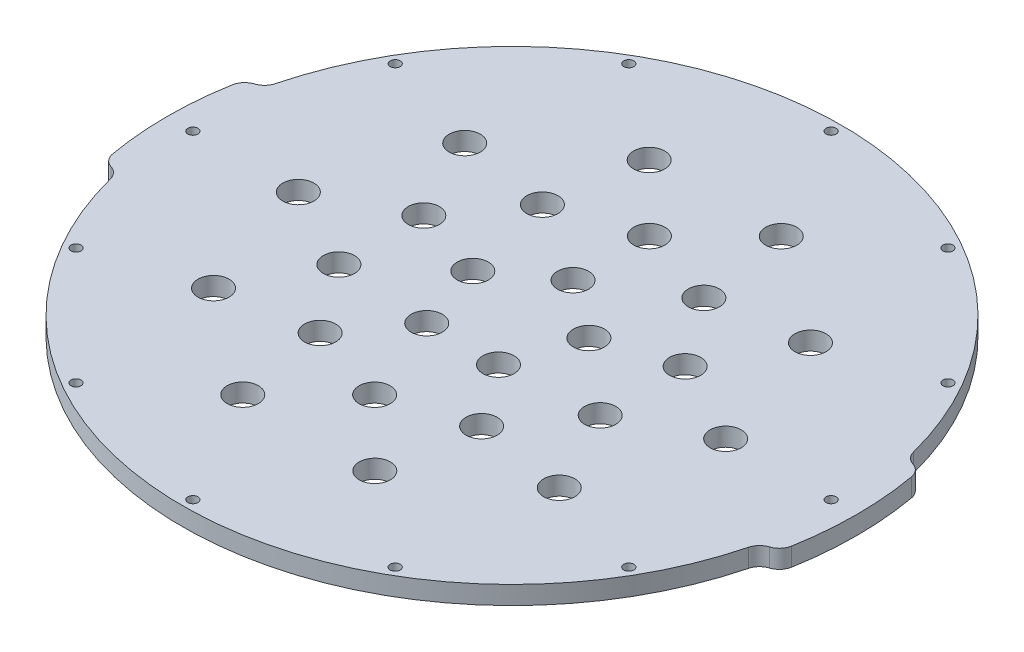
ISO-10303-21;
HEADER;
FILE_DESCRIPTION(('STEP AP214'),'2;1');
FILE_NAME('part.step','',(''),(''),'','','');
FILE_SCHEMA(('AUTOMOTIVE_DESIGN { 1 0 10303 214 1 1 1 1 }'));
ENDSEC;
DATA;
#1=APPLICATION_CONTEXT('core data for automotive mechanical design processes');
#2=APPLICATION_PROTOCOL_DEFINITION('international standard','automotive_design',2000,#1);
#3=PRODUCT_CONTEXT('',#1,'mechanical');
#4=PRODUCT('Part','Part','',(#3));
#5=PRODUCT_RELATED_PRODUCT_CATEGORY('part','',(#4));
#6=PRODUCT_DEFINITION_FORMATION('','',#4);
#7=PRODUCT_DEFINITION_CONTEXT('part definition',#1,'design');
#8=PRODUCT_DEFINITION('design','',#6,#7);
#9=PRODUCT_DEFINITION_SHAPE('','',#8);
#10=(LENGTH_UNIT() NAMED_UNIT(*) SI_UNIT(.MILLI.,.METRE.));
#11=(NAMED_UNIT(*) PLANE_ANGLE_UNIT() SI_UNIT($,.RADIAN.));
#12=(NAMED_UNIT(*) SI_UNIT($,.STERADIAN.) SOLID_ANGLE_UNIT());
#13=UNCERTAINTY_MEASURE_WITH_UNIT(LENGTH_MEASURE(1.E-05),#10,'distance_accuracy_value','');
#14=(GEOMETRIC_REPRESENTATION_CONTEXT(3) GLOBAL_UNCERTAINTY_ASSIGNED_CONTEXT((#13)) GLOBAL_UNIT_ASSIGNED_CONTEXT((#10,
#11,#12)) REPRESENTATION_CONTEXT('',''));
#15=CARTESIAN_POINT('',(0.,0.,0.));
#16=DIRECTION('',(0.,0.,1.));
#17=DIRECTION('',(1.,0.,0.));
#18=AXIS2_PLACEMENT_3D('',#15,#16,#17);
#19=CARTESIAN_POINT('',(-53.1549984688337,6.,-9.37266038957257));
#20=DIRECTION('',(0.,-1.,0.));
#21=DIRECTION('',(0.,0.,-1.));
#22=AXIS2_PLACEMENT_3D('',#19,#20,#21);
#23=PLANE('',#22);
#24=CARTESIAN_POINT('',(56.6311896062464,6.,41.1449676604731));
#25=DIRECTION('',(0.,1.,0.));
#26=DIRECTION('',(0.,0.,1.));
#27=AXIS2_PLACEMENT_3D('',#24,#25,#26);
#28=CIRCLE('',#27,5.1);
#29=CARTESIAN_POINT('',(56.6311896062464,6.,46.2449676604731));
#30=VERTEX_POINT('',#29);
#31=EDGE_CURVE('E516',#30,#30,#28,.T.);
#32=ORIENTED_EDGE('',*,*,#31,.F.);
#33=EDGE_LOOP('',(#32));
#34=FACE_BOUND('',#33,.T.);
#35=CARTESIAN_POINT('',(70.,6.,0.));
#36=DIRECTION('',(0.,1.,0.));
#37=DIRECTION('',(0.,0.,1.));
#38=AXIS2_PLACEMENT_3D('',#35,#36,#37);
#39=CIRCLE('',#38,5.10000000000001);
#40=CARTESIAN_POINT('',(70.,6.,5.09999999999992));
#41=VERTEX_POINT('',#40);
#42=EDGE_CURVE('E510',#41,#41,#39,.T.);
#43=ORIENTED_EDGE('',*,*,#42,.F.);
#44=EDGE_LOOP('',(#43));
#45=FACE_BOUND('',#44,.T.);
#46=CARTESIAN_POINT('',(56.6311896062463,6.,-41.1449676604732));
#47=DIRECTION('',(0.,1.,0.));
#48=DIRECTION('',(0.,0.,1.));
#49=AXIS2_PLACEMENT_3D('',#46,#47,#48);
#50=CIRCLE('',#49,5.10000000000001);
#51=CARTESIAN_POINT('',(56.6311896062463,6.,-36.0449676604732));
#52=VERTEX_POINT('',#51);
#53=EDGE_CURVE('E504',#52,#52,#50,.T.);
#54=ORIENTED_EDGE('',*,*,#53,.F.);
#55=EDGE_LOOP('',(#54));
#56=FACE_BOUND('',#55,.T.);
#57=CARTESIAN_POINT('',(21.6311896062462,6.,-66.5739561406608));
#58=DIRECTION('',(0.,1.,0.));
#59=DIRECTION('',(0.,0.,1.));
#60=AXIS2_PLACEMENT_3D('',#57,#58,#59);
#61=CIRCLE('',#60,5.10000000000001);
#62=CARTESIAN_POINT('',(21.6311896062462,6.,-61.4739561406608));
#63=VERTEX_POINT('',#62);
#64=EDGE_CURVE('E498',#63,#63,#61,.T.);
#65=ORIENTED_EDGE('',*,*,#64,.F.);
#66=EDGE_LOOP('',(#65));
#67=FACE_BOUND('',#66,.T.);
#68=CARTESIAN_POINT('',(-21.6311896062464,6.,-66.5739561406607));
#69=DIRECTION('',(0.,1.,0.));
#70=DIRECTION('',(0.,0.,1.));
#71=AXIS2_PLACEMENT_3D('',#68,#69,#70);
#72=CIRCLE('',#71,5.10000000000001);
#73=CARTESIAN_POINT('',(-21.6311896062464,6.,-61.4739561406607));
#74=VERTEX_POINT('',#73);
#75=EDGE_CURVE('E492',#74,#74,#72,.T.);
#76=ORIENTED_EDGE('',*,*,#75,.F.);
#77=EDGE_LOOP('',(#76));
#78=FACE_BOUND('',#77,.T.);
#79=CARTESIAN_POINT('',(-56.6311896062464,6.,-41.1449676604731));
#80=DIRECTION('',(0.,1.,0.));
#81=DIRECTION('',(0.,0.,1.));
#82=AXIS2_PLACEMENT_3D('',#79,#80,#81);
#83=CIRCLE('',#82,5.10000000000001);
#84=CARTESIAN_POINT('',(-56.6311896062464,6.,-36.044967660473));
#85=VERTEX_POINT('',#84);
#86=EDGE_CURVE('E486',#85,#85,#83,.T.);
#87=ORIENTED_EDGE('',*,*,#86,.F.);
#88=EDGE_LOOP('',(#87));
#89=FACE_BOUND('',#88,.T.);
#90=CARTESIAN_POINT('',(-70.,6.,0.));
#91=DIRECTION('',(0.,1.,0.));
#92=DIRECTION('',(0.,0.,1.));
#93=AXIS2_PLACEMENT_3D('',#90,#91,#92);
#94=CIRCLE('',#93,5.10000000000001);
#95=CARTESIAN_POINT('',(-70.,6.,5.1000000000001));
#96=VERTEX_POINT('',#95);
#97=EDGE_CURVE('E480',#96,#96,#94,.T.);
#98=ORIENTED_EDGE('',*,*,#97,.F.);
#99=EDGE_LOOP('',(#98));
#100=FACE_BOUND('',#99,.T.);
#101=CARTESIAN_POINT('',(-56.6311896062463,6.,41.1449676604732));
#102=DIRECTION('',(0.,1.,0.));
#103=DIRECTION('',(0.,0.,1.));
#104=AXIS2_PLACEMENT_3D('',#101,#102,#103);
#105=CIRCLE('',#104,5.10000000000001);
#106=CARTESIAN_POINT('',(-56.6311896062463,6.,46.2449676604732));
#107=VERTEX_POINT('',#106);
#108=EDGE_CURVE('E474',#107,#107,#105,.T.);
#109=ORIENTED_EDGE('',*,*,#108,.F.);
#110=EDGE_LOOP('',(#109));
#111=FACE_BOUND('',#110,.T.);
#112=CARTESIAN_POINT('',(-21.6311896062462,6.,66.5739561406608));
#113=DIRECTION('',(0.,1.,0.));
#114=DIRECTION('',(0.,0.,1.));
#115=AXIS2_PLACEMENT_3D('',#112,#113,#114);
#116=CIRCLE('',#115,5.10000000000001);
#117=CARTESIAN_POINT('',(-21.6311896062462,6.,71.6739561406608));
#118=VERTEX_POINT('',#117);
#119=EDGE_CURVE('E468',#118,#118,#116,.T.);
#120=ORIENTED_EDGE('',*,*,#119,.F.);
#121=EDGE_LOOP('',(#120));
#122=FACE_BOUND('',#121,.T.);
#123=CARTESIAN_POINT('',(21.6311896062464,6.,66.5739561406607));
#124=DIRECTION('',(0.,1.,0.));
#125=DIRECTION('',(0.,0.,1.));
#126=AXIS2_PLACEMENT_3D('',#123,#124,#125);
#127=CIRCLE('',#126,5.10000000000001);
#128=CARTESIAN_POINT('',(21.6311896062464,6.,71.6739561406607));
#129=VERTEX_POINT('',#128);
#130=EDGE_CURVE('E462',#129,#129,#127,.T.);
#131=ORIENTED_EDGE('',*,*,#130,.F.);
#132=EDGE_LOOP('',(#131));
#133=FACE_BOUND('',#132,.T.);
#134=CARTESIAN_POINT('',(19.0211303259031,6.,-6.18033988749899));
#135=DIRECTION('',(0.,1.,0.));
#136=DIRECTION('',(0.,0.,1.));
#137=AXIS2_PLACEMENT_3D('',#134,#135,#136);
#138=CIRCLE('',#137,5.1);
#139=CARTESIAN_POINT('',(19.0211303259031,6.,-1.08033988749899));
#140=VERTEX_POINT('',#139);
#141=EDGE_CURVE('E456',#140,#140,#138,.T.);
#142=ORIENTED_EDGE('',*,*,#141,.F.);
#143=EDGE_LOOP('',(#142));
#144=FACE_BOUND('',#143,.T.);
#145=CARTESIAN_POINT('',(0.,6.,-20.));
#146=DIRECTION('',(0.,1.,0.));
#147=DIRECTION('',(0.,0.,1.));
#148=AXIS2_PLACEMENT_3D('',#145,#146,#147);
#149=CIRCLE('',#148,5.1);
#150=CARTESIAN_POINT('',(0.,6.,-14.9));
#151=VERTEX_POINT('',#150);
#152=EDGE_CURVE('E450',#151,#151,#149,.T.);
#153=ORIENTED_EDGE('',*,*,#152,.F.);
#154=EDGE_LOOP('',(#153));
#155=FACE_BOUND('',#154,.T.);
#156=CARTESIAN_POINT('',(-19.0211303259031,6.,-6.18033988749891));
#157=DIRECTION('',(0.,1.,0.));
#158=DIRECTION('',(0.,0.,1.));
#159=AXIS2_PLACEMENT_3D('',#156,#157,#158);
#160=CIRCLE('',#159,5.1);
#161=CARTESIAN_POINT('',(-19.0211303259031,6.,-1.08033988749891));
#162=VERTEX_POINT('',#161);
#163=EDGE_CURVE('E444',#162,#162,#160,.T.);
#164=ORIENTED_EDGE('',*,*,#163,.F.);
#165=EDGE_LOOP('',(#164));
#166=FACE_BOUND('',#165,.T.);
#167=CARTESIAN_POINT('',(-11.7557050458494,6.,16.180339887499));
#168=DIRECTION('',(0.,1.,0.));
#169=DIRECTION('',(0.,0.,1.));
#170=AXIS2_PLACEMENT_3D('',#167,#168,#169);
#171=CIRCLE('',#170,5.1);
#172=CARTESIAN_POINT('',(-11.7557050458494,6.,21.280339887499));
#173=VERTEX_POINT('',#172);
#174=EDGE_CURVE('E438',#173,#173,#171,.T.);
#175=ORIENTED_EDGE('',*,*,#174,.F.);
#176=EDGE_LOOP('',(#175));
#177=FACE_BOUND('',#176,.T.);
#178=CARTESIAN_POINT('',(-26.4503363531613,6.,-36.4057647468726));
#179=DIRECTION('',(0.,1.,0.));
#180=DIRECTION('',(0.,0.,1.));
#181=AXIS2_PLACEMENT_3D('',#178,#179,#180);
#182=CIRCLE('',#181,5.1);
#183=CARTESIAN_POINT('',(-26.4503363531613,6.,-31.3057647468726));
#184=VERTEX_POINT('',#183);
#185=EDGE_CURVE('E432',#184,#184,#182,.T.);
#186=ORIENTED_EDGE('',*,*,#185,.F.);
#187=EDGE_LOOP('',(#186));
#188=FACE_BOUND('',#187,.T.);
#189=CARTESIAN_POINT('',(-42.7975432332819,6.,-13.9057647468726));
#190=DIRECTION('',(0.,1.,0.));
#191=DIRECTION('',(0.,0.,1.));
#192=AXIS2_PLACEMENT_3D('',#189,#190,#191);
#193=CIRCLE('',#192,5.1);
#194=CARTESIAN_POINT('',(-42.7975432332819,6.,-8.80576474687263));
#195=VERTEX_POINT('',#194);
#196=EDGE_CURVE('E426',#195,#195,#193,.T.);
#197=ORIENTED_EDGE('',*,*,#196,.F.);
#198=EDGE_LOOP('',(#197));
#199=FACE_BOUND('',#198,.T.);
#200=CARTESIAN_POINT('',(-42.7975432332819,6.,13.9057647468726));
#201=DIRECTION('',(0.,1.,0.));
#202=DIRECTION('',(0.,0.,1.));
#203=AXIS2_PLACEMENT_3D('',#200,#201,#202);
#204=CIRCLE('',#203,5.1);
#205=CARTESIAN_POINT('',(-42.7975432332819,6.,19.0057647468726));
#206=VERTEX_POINT('',#205);
#207=EDGE_CURVE('E420',#206,#206,#204,.T.);
#208=ORIENTED_EDGE('',*,*,#207,.F.);
#209=EDGE_LOOP('',(#208));
#210=FACE_BOUND('',#209,.T.);
#211=CARTESIAN_POINT('',(-26.4503363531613,6.,36.4057647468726));
#212=DIRECTION('',(0.,1.,0.));
#213=DIRECTION('',(0.,0.,1.));
#214=AXIS2_PLACEMENT_3D('',#211,#212,#213);
#215=CIRCLE('',#214,5.1);
#216=CARTESIAN_POINT('',(-26.4503363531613,6.,41.5057647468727));
#217=VERTEX_POINT('',#216);
#218=EDGE_CURVE('E414',#217,#217,#215,.T.);
#219=ORIENTED_EDGE('',*,*,#218,.F.);
#220=EDGE_LOOP('',(#219));
#221=FACE_BOUND('',#220,.T.);
#222=CARTESIAN_POINT('',(0.,6.,45.));
#223=DIRECTION('',(0.,1.,0.));
#224=DIRECTION('',(0.,0.,1.));
#225=AXIS2_PLACEMENT_3D('',#222,#223,#224);
#226=CIRCLE('',#225,5.1);
#227=CARTESIAN_POINT('',(0.,6.,50.1));
#228=VERTEX_POINT('',#227);
#229=EDGE_CURVE('E408',#228,#228,#226,.T.);
#230=ORIENTED_EDGE('',*,*,#229,.F.);
#231=EDGE_LOOP('',(#230));
#232=FACE_BOUND('',#231,.T.);
#233=CARTESIAN_POINT('',(11.7557050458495,6.,16.1803398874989));
#234=DIRECTION('',(0.,1.,0.));
#235=DIRECTION('',(0.,0.,1.));
#236=AXIS2_PLACEMENT_3D('',#233,#234,#235);
#237=CIRCLE('',#236,5.1);
#238=CARTESIAN_POINT('',(11.7557050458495,6.,21.2803398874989));
#239=VERTEX_POINT('',#238);
#240=EDGE_CURVE('E402',#239,#239,#237,.T.);
#241=ORIENTED_EDGE('',*,*,#240,.F.);
#242=EDGE_LOOP('',(#241));
#243=FACE_BOUND('',#242,.T.);
#244=CARTESIAN_POINT('',(26.4503363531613,6.,36.4057647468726));
#245=DIRECTION('',(0.,1.,0.));
#246=DIRECTION('',(0.,0.,1.));
#247=AXIS2_PLACEMENT_3D('',#244,#245,#246);
#248=CIRCLE('',#247,5.09999999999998);
#249=CARTESIAN_POINT('',(26.4503363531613,6.,41.5057647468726));
#250=VERTEX_POINT('',#249);
#251=EDGE_CURVE('E396',#250,#250,#248,.T.);
#252=ORIENTED_EDGE('',*,*,#251,.F.);
#253=EDGE_LOOP('',(#252));
#254=FACE_BOUND('',#253,.T.);
#255=CARTESIAN_POINT('',(42.7975432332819,6.,13.9057647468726));
#256=DIRECTION('',(0.,1.,0.));
#257=DIRECTION('',(0.,0.,1.));
#258=AXIS2_PLACEMENT_3D('',#255,#256,#257);
#259=CIRCLE('',#258,5.10000000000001);
#260=CARTESIAN_POINT('',(42.7975432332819,6.,19.0057647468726));
#261=VERTEX_POINT('',#260);
#262=EDGE_CURVE('E390',#261,#261,#259,.T.);
#263=ORIENTED_EDGE('',*,*,#262,.F.);
#264=EDGE_LOOP('',(#263));
#265=FACE_BOUND('',#264,.T.);
#266=CARTESIAN_POINT('',(42.7975432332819,6.,-13.9057647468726));
#267=DIRECTION('',(0.,1.,0.));
#268=DIRECTION('',(0.,0.,1.));
#269=AXIS2_PLACEMENT_3D('',#266,#267,#268);
#270=CIRCLE('',#269,5.09999999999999);
#271=CARTESIAN_POINT('',(42.7975432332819,6.,-8.80576474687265));
#272=VERTEX_POINT('',#271);
#273=EDGE_CURVE('E384',#272,#272,#270,.T.);
#274=ORIENTED_EDGE('',*,*,#273,.F.);
#275=EDGE_LOOP('',(#274));
#276=FACE_BOUND('',#275,.T.);
#277=CARTESIAN_POINT('',(26.4503363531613,6.,-36.4057647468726));
#278=DIRECTION('',(0.,1.,0.));
#279=DIRECTION('',(0.,0.,1.));
#280=AXIS2_PLACEMENT_3D('',#277,#278,#279);
#281=CIRCLE('',#280,5.09999999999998);
#282=CARTESIAN_POINT('',(26.4503363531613,6.,-31.3057647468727));
#283=VERTEX_POINT('',#282);
#284=EDGE_CURVE('E378',#283,#283,#281,.T.);
#285=ORIENTED_EDGE('',*,*,#284,.F.);
#286=EDGE_LOOP('',(#285));
#287=FACE_BOUND('',#286,.T.);
#288=CARTESIAN_POINT('',(0.,6.,-45.));
#289=DIRECTION('',(0.,1.,0.));
#290=DIRECTION('',(0.,0.,1.));
#291=AXIS2_PLACEMENT_3D('',#288,#289,#290);
#292=CIRCLE('',#291,5.1);
#293=CARTESIAN_POINT('',(0.,6.,-39.9));
#294=VERTEX_POINT('',#293);
#295=EDGE_CURVE('E372',#294,#294,#292,.T.);
#296=ORIENTED_EDGE('',*,*,#295,.F.);
#297=EDGE_LOOP('',(#296));
#298=FACE_BOUND('',#297,.T.);
#299=CARTESIAN_POINT('',(-90.5429559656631,6.,-52.2749999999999));
#300=DIRECTION('',(0.,1.,0.));
#301=DIRECTION('',(0.,0.,1.));
#302=AXIS2_PLACEMENT_3D('',#299,#300,#301);
#303=CIRCLE('',#302,1.65000000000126);
#304=CARTESIAN_POINT('',(-90.5429559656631,6.,-50.6249999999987));
#305=VERTEX_POINT('',#304);
#306=EDGE_CURVE('E357',#305,#305,#303,.T.);
#307=ORIENTED_EDGE('',*,*,#306,.F.);
#308=EDGE_LOOP('',(#307));
#309=FACE_BOUND('',#308,.T.);
#310=CARTESIAN_POINT('',(-90.542955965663,6.,52.2750000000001));
#311=DIRECTION('',(0.,1.,0.));
#312=DIRECTION('',(0.,0.,1.));
#313=AXIS2_PLACEMENT_3D('',#310,#311,#312);
#314=CIRCLE('',#313,1.65000000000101);
#315=CARTESIAN_POINT('',(-90.542955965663,6.,53.9250000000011));
#316=VERTEX_POINT('',#315);
#317=EDGE_CURVE('E345',#316,#316,#314,.T.);
#318=ORIENTED_EDGE('',*,*,#317,.F.);
#319=EDGE_LOOP('',(#318));
#320=FACE_BOUND('',#319,.T.);
#321=CARTESIAN_POINT('',(0.,6.,104.55));
#322=DIRECTION('',(0.,1.,0.));
#323=DIRECTION('',(0.,0.,1.));
#324=AXIS2_PLACEMENT_3D('',#321,#322,#323);
#325=CIRCLE('',#324,1.65000000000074);
#326=CARTESIAN_POINT('',(0.,6.,106.200000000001));
#327=VERTEX_POINT('',#326);
#328=EDGE_CURVE('E333',#327,#327,#325,.T.);
#329=ORIENTED_EDGE('',*,*,#328,.F.);
#330=EDGE_LOOP('',(#329));
#331=FACE_BOUND('',#330,.T.);
#332=CARTESIAN_POINT('',(90.5429559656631,6.,52.275));
#333=DIRECTION('',(0.,1.,0.));
#334=DIRECTION('',(0.,0.,1.));
#335=AXIS2_PLACEMENT_3D('',#332,#333,#334);
#336=CIRCLE('',#335,1.65000000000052);
#337=CARTESIAN_POINT('',(90.5429559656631,6.,53.9250000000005));
#338=VERTEX_POINT('',#337);
#339=EDGE_CURVE('E321',#338,#338,#336,.T.);
#340=ORIENTED_EDGE('',*,*,#339,.F.);
#341=EDGE_LOOP('',(#340));
#342=FACE_BOUND('',#341,.T.);
#343=CARTESIAN_POINT('',(90.5429559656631,6.,-52.275));
#344=DIRECTION('',(0.,1.,0.));
#345=DIRECTION('',(0.,0.,1.));
#346=AXIS2_PLACEMENT_3D('',#343,#344,#345);
#347=CIRCLE('',#346,1.65000000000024);
#348=CARTESIAN_POINT('',(90.5429559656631,6.,-50.6249999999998));
#349=VERTEX_POINT('',#348);
#350=EDGE_CURVE('E309',#349,#349,#347,.T.);
#351=ORIENTED_EDGE('',*,*,#350,.F.);
#352=EDGE_LOOP('',(#351));
#353=FACE_BOUND('',#352,.T.);
#354=CARTESIAN_POINT('',(0.,6.,-104.55));
#355=DIRECTION('',(0.,1.,0.));
#356=DIRECTION('',(0.,0.,1.));
#357=AXIS2_PLACEMENT_3D('',#354,#355,#356);
#358=CIRCLE('',#357,1.65);
#359=CARTESIAN_POINT('',(0.,6.,-102.9));
#360=VERTEX_POINT('',#359);
#361=EDGE_CURVE('E277',#360,#360,#358,.T.);
#362=ORIENTED_EDGE('',*,*,#361,.F.);
#363=EDGE_LOOP('',(#362));
#364=FACE_BOUND('',#363,.T.);
#365=CARTESIAN_POINT('',(0.,6.,0.));
#366=DIRECTION('',(0.,1.,0.));
#367=DIRECTION('',(0.,0.,-1.));
#368=AXIS2_PLACEMENT_3D('',#365,#366,#367);
#369=CIRCLE('',#368,107.95);
#370=CARTESIAN_POINT('',(104.513991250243,6.,-27.0190327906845));
#371=VERTEX_POINT('',#370);
#372=CARTESIAN_POINT('',(-104.513991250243,6.,-27.0190327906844));
#373=VERTEX_POINT('',#372);
#374=EDGE_CURVE('E272',#371,#373,#369,.T.);
#375=ORIENTED_EDGE('',*,*,#374,.T.);
#376=CARTESIAN_POINT('',(-109.354843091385,6.,-28.2704933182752));
#377=DIRECTION('',(0.,-1.,0.));
#378=DIRECTION('',(0.,0.,-1.));
#379=AXIS2_PLACEMENT_3D('',#376,#377,#378);
#380=CIRCLE('',#379,5.);
#381=CARTESIAN_POINT('',(-107.832420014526,6.,-23.5079070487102));
#382=VERTEX_POINT('',#381);
#383=EDGE_CURVE('E127',#373,#382,#380,.T.);
#384=ORIENTED_EDGE('',*,*,#383,.T.);
#385=CARTESIAN_POINT('',(-106.309996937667,6.,-18.7453207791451));
#386=DIRECTION('',(0.,1.,0.));
#387=DIRECTION('',(0.,0.,-1.));
#388=AXIS2_PLACEMENT_3D('',#385,#386,#387);
#389=CIRCLE('',#388,5.00000000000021);
#390=CARTESIAN_POINT('',(-111.234035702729,6.,-19.6135616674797));
#391=VERTEX_POINT('',#390);
#392=EDGE_CURVE('E120',#382,#391,#389,.T.);
#393=ORIENTED_EDGE('',*,*,#392,.T.);
#394=CARTESIAN_POINT('',(0.,6.,0.));
#395=DIRECTION('',(0.,1.,0.));
#396=DIRECTION('',(0.,0.,-1.));
#397=AXIS2_PLACEMENT_3D('',#394,#395,#396);
#398=CIRCLE('',#397,112.95);
#399=CARTESIAN_POINT('',(-111.234035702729,6.,19.6135616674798));
#400=VERTEX_POINT('',#399);
#401=EDGE_CURVE('E124',#391,#400,#398,.T.);
#402=ORIENTED_EDGE('',*,*,#401,.T.);
#403=CARTESIAN_POINT('',(-106.309996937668,6.,18.7453207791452));
#404=DIRECTION('',(0.,1.,0.));
#405=DIRECTION('',(0.,0.,1.));
#406=AXIS2_PLACEMENT_3D('',#403,#404,#405);
#407=CIRCLE('',#406,5.00000000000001);
#408=CARTESIAN_POINT('',(-107.832420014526,6.,23.5079070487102));
#409=VERTEX_POINT('',#408);
#410=EDGE_CURVE('E140',#400,#409,#407,.T.);
#411=ORIENTED_EDGE('',*,*,#410,.T.);
#412=CARTESIAN_POINT('',(-109.354843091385,6.,28.2704933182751));
#413=DIRECTION('',(0.,-1.,0.));
#414=DIRECTION('',(0.,0.,-1.));
#415=AXIS2_PLACEMENT_3D('',#412,#413,#414);
#416=CIRCLE('',#415,5.);
#417=CARTESIAN_POINT('',(-104.513991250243,6.,27.0190327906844));
#418=VERTEX_POINT('',#417);
#419=EDGE_CURVE('E11',#409,#418,#416,.T.);
#420=ORIENTED_EDGE('',*,*,#419,.T.);
#421=CARTESIAN_POINT('',(0.,6.,-4.92661467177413E-13));
#422=DIRECTION('',(0.,1.,0.));
#423=DIRECTION('',(0.,0.,-1.));
#424=AXIS2_PLACEMENT_3D('',#421,#422,#423);
#425=CIRCLE('',#424,107.95);
#426=CARTESIAN_POINT('',(104.513991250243,6.,27.0190327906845));
#427=VERTEX_POINT('',#426);
#428=EDGE_CURVE('E259',#418,#427,#425,.T.);
#429=ORIENTED_EDGE('',*,*,#428,.T.);
#430=CARTESIAN_POINT('',(109.354843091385,6.,28.2704933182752));
#431=DIRECTION('',(0.,-1.,0.));
#432=DIRECTION('',(0.,0.,-1.));
#433=AXIS2_PLACEMENT_3D('',#430,#431,#432);
#434=CIRCLE('',#433,5.);
#435=CARTESIAN_POINT('',(107.832420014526,6.,23.5079070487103));
#436=VERTEX_POINT('',#435);
#437=EDGE_CURVE('E171',#427,#436,#434,.T.);
#438=ORIENTED_EDGE('',*,*,#437,.T.);
#439=CARTESIAN_POINT('',(106.309996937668,6.,18.7453207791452));
#440=DIRECTION('',(0.,1.,0.));
#441=DIRECTION('',(0.,0.,-1.));
#442=AXIS2_PLACEMENT_3D('',#439,#440,#441);
#443=CIRCLE('',#442,5.00000000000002);
#444=CARTESIAN_POINT('',(111.234035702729,6.,19.6135616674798));
#445=VERTEX_POINT('',#444);
#446=EDGE_CURVE('E256',#436,#445,#443,.T.);
#447=ORIENTED_EDGE('',*,*,#446,.T.);
#448=CARTESIAN_POINT('',(-1.29063426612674E-12,6.,0.));
#449=DIRECTION('',(0.,1.,0.));
#450=DIRECTION('',(0.,0.,1.));
#451=AXIS2_PLACEMENT_3D('',#448,#449,#450);
#452=CIRCLE('',#451,112.950000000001);
#453=CARTESIAN_POINT('',(111.234035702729,6.,-19.6135616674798));
#454=VERTEX_POINT('',#453);
#455=EDGE_CURVE('E263',#445,#454,#452,.T.);
#456=ORIENTED_EDGE('',*,*,#455,.T.);
#457=CARTESIAN_POINT('',(106.309996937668,6.,-18.7453207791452));
#458=DIRECTION('',(0.,1.,0.));
#459=DIRECTION('',(0.,0.,1.));
#460=AXIS2_PLACEMENT_3D('',#457,#458,#459);
#461=CIRCLE('',#460,5.);
#462=CARTESIAN_POINT('',(107.832420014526,6.,-23.5079070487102));
#463=VERTEX_POINT('',#462);
#464=EDGE_CURVE('E265',#454,#463,#461,.T.);
#465=ORIENTED_EDGE('',*,*,#464,.T.);
#466=CARTESIAN_POINT('',(109.354843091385,6.,-28.2704933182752));
#467=DIRECTION('',(0.,-1.,0.));
#468=DIRECTION('',(0.,0.,-1.));
#469=AXIS2_PLACEMENT_3D('',#466,#467,#468);
#470=CIRCLE('',#469,5.);
#471=EDGE_CURVE('E175',#463,#371,#470,.T.);
#472=ORIENTED_EDGE('',*,*,#471,.T.);
#473=EDGE_LOOP('',(#375,#384,#393,#402,#411,#420,#429,#438,#447,#456,#465,#472));
#474=FACE_BOUND('',#473,.T.);
#475=CARTESIAN_POINT('',(52.275,6.,-90.5429559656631));
#476=DIRECTION('',(0.,1.,0.));
#477=DIRECTION('',(0.,0.,1.));
#478=AXIS2_PLACEMENT_3D('',#475,#476,#477);
#479=CIRCLE('',#478,1.65000000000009);
#480=CARTESIAN_POINT('',(52.275,6.,-88.892955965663));
#481=VERTEX_POINT('',#480);
#482=EDGE_CURVE('E303',#481,#481,#479,.T.);
#483=ORIENTED_EDGE('',*,*,#482,.F.);
#484=EDGE_LOOP('',(#483));
#485=FACE_BOUND('',#484,.T.);
#486=CARTESIAN_POINT('',(104.55,6.,0.));
#487=DIRECTION('',(0.,1.,0.));
#488=DIRECTION('',(0.,0.,1.));
#489=AXIS2_PLACEMENT_3D('',#486,#487,#488);
#490=CIRCLE('',#489,1.65000000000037);
#491=CARTESIAN_POINT('',(104.55,6.,1.65000000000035));
#492=VERTEX_POINT('',#491);
#493=EDGE_CURVE('E315',#492,#492,#490,.T.);
#494=ORIENTED_EDGE('',*,*,#493,.F.);
#495=EDGE_LOOP('',(#494));
#496=FACE_BOUND('',#495,.T.);
#497=CARTESIAN_POINT('',(52.2750000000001,6.,90.542955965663));
#498=DIRECTION('',(0.,1.,0.));
#499=DIRECTION('',(0.,0.,1.));
#500=AXIS2_PLACEMENT_3D('',#497,#498,#499);
#501=CIRCLE('',#500,1.65000000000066);
#502=CARTESIAN_POINT('',(52.2750000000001,6.,92.1929559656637));
#503=VERTEX_POINT('',#502);
#504=EDGE_CURVE('E327',#503,#503,#501,.T.);
#505=ORIENTED_EDGE('',*,*,#504,.F.);
#506=EDGE_LOOP('',(#505));
#507=FACE_BOUND('',#506,.T.);
#508=CARTESIAN_POINT('',(-52.2749999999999,6.,90.5429559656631));
#509=DIRECTION('',(0.,1.,0.));
#510=DIRECTION('',(0.,0.,1.));
#511=AXIS2_PLACEMENT_3D('',#508,#509,#510);
#512=CIRCLE('',#511,1.65000000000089);
#513=CARTESIAN_POINT('',(-52.2749999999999,6.,92.192955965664));
#514=VERTEX_POINT('',#513);
#515=EDGE_CURVE('E339',#514,#514,#512,.T.);
#516=ORIENTED_EDGE('',*,*,#515,.F.);
#517=EDGE_LOOP('',(#516));
#518=FACE_BOUND('',#517,.T.);
#519=CARTESIAN_POINT('',(-104.55,6.,0.));
#520=DIRECTION('',(0.,1.,0.));
#521=DIRECTION('',(0.,0.,1.));
#522=AXIS2_PLACEMENT_3D('',#519,#520,#521);
#523=CIRCLE('',#522,1.65000000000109);
#524=CARTESIAN_POINT('',(-104.55,6.,1.65000000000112));
#525=VERTEX_POINT('',#524);
#526=EDGE_CURVE('E351',#525,#525,#523,.T.);
#527=ORIENTED_EDGE('',*,*,#526,.F.);
#528=EDGE_LOOP('',(#527));
#529=FACE_BOUND('',#528,.T.);
#530=CARTESIAN_POINT('',(-52.275,6.,-90.542955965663));
#531=DIRECTION('',(0.,1.,0.));
#532=DIRECTION('',(0.,0.,1.));
#533=AXIS2_PLACEMENT_3D('',#530,#531,#532);
#534=CIRCLE('',#533,1.65000000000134);
#535=CARTESIAN_POINT('',(-52.275,6.,-88.8929559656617));
#536=VERTEX_POINT('',#535);
#537=EDGE_CURVE('E363',#536,#536,#534,.T.);
#538=ORIENTED_EDGE('',*,*,#537,.F.);
#539=EDGE_LOOP('',(#538));
#540=FACE_BOUND('',#539,.T.);
#541=ADVANCED_FACE('F32',(#34,#45,#56,#67,#78,#89,#100,#111,#122,#133,#144,#155,#166,#177,#188,
#199,#210,#221,#232,#243,#254,#265,#276,#287,#298,#309,#320,#331,#342,#353,#364,#474,#485,#496,
#507,#518,#529,#540),#23,.F.);
#542=CARTESIAN_POINT('',(-53.1549984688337,0.,-9.37266038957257));
#543=DIRECTION('',(0.,-1.,0.));
#544=DIRECTION('',(0.,0.,-1.));
#545=AXIS2_PLACEMENT_3D('',#542,#543,#544);
#546=PLANE('',#545);
#547=CARTESIAN_POINT('',(56.6311896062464,0.,41.1449676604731));
#548=DIRECTION('',(0.,1.,0.));
#549=DIRECTION('',(0.,0.,1.));
#550=AXIS2_PLACEMENT_3D('',#547,#548,#549);
#551=CIRCLE('',#550,5.1);
#552=CARTESIAN_POINT('',(56.6311896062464,0.,46.2449676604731));
#553=VERTEX_POINT('',#552);
#554=EDGE_CURVE('E513',#553,#553,#551,.T.);
#555=ORIENTED_EDGE('',*,*,#554,.T.);
#556=EDGE_LOOP('',(#555));
#557=FACE_BOUND('',#556,.T.);
#558=CARTESIAN_POINT('',(70.,0.,0.));
#559=DIRECTION('',(0.,1.,0.));
#560=DIRECTION('',(0.,0.,1.));
#561=AXIS2_PLACEMENT_3D('',#558,#559,#560);
#562=CIRCLE('',#561,5.10000000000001);
#563=CARTESIAN_POINT('',(70.,0.,5.09999999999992));
#564=VERTEX_POINT('',#563);
#565=EDGE_CURVE('E507',#564,#564,#562,.T.);
#566=ORIENTED_EDGE('',*,*,#565,.T.);
#567=EDGE_LOOP('',(#566));
#568=FACE_BOUND('',#567,.T.);
#569=CARTESIAN_POINT('',(56.6311896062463,0.,-41.1449676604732));
#570=DIRECTION('',(0.,1.,0.));
#571=DIRECTION('',(0.,0.,1.));
#572=AXIS2_PLACEMENT_3D('',#569,#570,#571);
#573=CIRCLE('',#572,5.10000000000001);
#574=CARTESIAN_POINT('',(56.6311896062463,0.,-36.0449676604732));
#575=VERTEX_POINT('',#574);
#576=EDGE_CURVE('E501',#575,#575,#573,.T.);
#577=ORIENTED_EDGE('',*,*,#576,.T.);
#578=EDGE_LOOP('',(#577));
#579=FACE_BOUND('',#578,.T.);
#580=CARTESIAN_POINT('',(21.6311896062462,0.,-66.5739561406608));
#581=DIRECTION('',(0.,1.,0.));
#582=DIRECTION('',(0.,0.,1.));
#583=AXIS2_PLACEMENT_3D('',#580,#581,#582);
#584=CIRCLE('',#583,5.10000000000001);
#585=CARTESIAN_POINT('',(21.6311896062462,0.,-61.4739561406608));
#586=VERTEX_POINT('',#585);
#587=EDGE_CURVE('E495',#586,#586,#584,.T.);
#588=ORIENTED_EDGE('',*,*,#587,.T.);
#589=EDGE_LOOP('',(#588));
#590=FACE_BOUND('',#589,.T.);
#591=CARTESIAN_POINT('',(-21.6311896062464,0.,-66.5739561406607));
#592=DIRECTION('',(0.,1.,0.));
#593=DIRECTION('',(0.,0.,1.));
#594=AXIS2_PLACEMENT_3D('',#591,#592,#593);
#595=CIRCLE('',#594,5.10000000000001);
#596=CARTESIAN_POINT('',(-21.6311896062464,0.,-61.4739561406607));
#597=VERTEX_POINT('',#596);
#598=EDGE_CURVE('E489',#597,#597,#595,.T.);
#599=ORIENTED_EDGE('',*,*,#598,.T.);
#600=EDGE_LOOP('',(#599));
#601=FACE_BOUND('',#600,.T.);
#602=CARTESIAN_POINT('',(-56.6311896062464,0.,-41.1449676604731));
#603=DIRECTION('',(0.,1.,0.));
#604=DIRECTION('',(0.,0.,1.));
#605=AXIS2_PLACEMENT_3D('',#602,#603,#604);
#606=CIRCLE('',#605,5.10000000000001);
#607=CARTESIAN_POINT('',(-56.6311896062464,0.,-36.044967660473));
#608=VERTEX_POINT('',#607);
#609=EDGE_CURVE('E483',#608,#608,#606,.T.);
#610=ORIENTED_EDGE('',*,*,#609,.T.);
#611=EDGE_LOOP('',(#610));
#612=FACE_BOUND('',#611,.T.);
#613=CARTESIAN_POINT('',(-70.,0.,0.));
#614=DIRECTION('',(0.,1.,0.));
#615=DIRECTION('',(0.,0.,1.));
#616=AXIS2_PLACEMENT_3D('',#613,#614,#615);
#617=CIRCLE('',#616,5.10000000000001);
#618=CARTESIAN_POINT('',(-70.,0.,5.1000000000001));
#619=VERTEX_POINT('',#618);
#620=EDGE_CURVE('E477',#619,#619,#617,.T.);
#621=ORIENTED_EDGE('',*,*,#620,.T.);
#622=EDGE_LOOP('',(#621));
#623=FACE_BOUND('',#622,.T.);
#624=CARTESIAN_POINT('',(-56.6311896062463,0.,41.1449676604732));
#625=DIRECTION('',(0.,1.,0.));
#626=DIRECTION('',(0.,0.,1.));
#627=AXIS2_PLACEMENT_3D('',#624,#625,#626);
#628=CIRCLE('',#627,5.10000000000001);
#629=CARTESIAN_POINT('',(-56.6311896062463,0.,46.2449676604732));
#630=VERTEX_POINT('',#629);
#631=EDGE_CURVE('E471',#630,#630,#628,.T.);
#632=ORIENTED_EDGE('',*,*,#631,.T.);
#633=EDGE_LOOP('',(#632));
#634=FACE_BOUND('',#633,.T.);
#635=CARTESIAN_POINT('',(-21.6311896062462,0.,66.5739561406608));
#636=DIRECTION('',(0.,1.,0.));
#637=DIRECTION('',(0.,0.,1.));
#638=AXIS2_PLACEMENT_3D('',#635,#636,#637);
#639=CIRCLE('',#638,5.10000000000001);
#640=CARTESIAN_POINT('',(-21.6311896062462,0.,71.6739561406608));
#641=VERTEX_POINT('',#640);
#642=EDGE_CURVE('E465',#641,#641,#639,.T.);
#643=ORIENTED_EDGE('',*,*,#642,.T.);
#644=EDGE_LOOP('',(#643));
#645=FACE_BOUND('',#644,.T.);
#646=CARTESIAN_POINT('',(21.6311896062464,0.,66.5739561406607));
#647=DIRECTION('',(0.,1.,0.));
#648=DIRECTION('',(0.,0.,1.));
#649=AXIS2_PLACEMENT_3D('',#646,#647,#648);
#650=CIRCLE('',#649,5.10000000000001);
#651=CARTESIAN_POINT('',(21.6311896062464,0.,71.6739561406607));
#652=VERTEX_POINT('',#651);
#653=EDGE_CURVE('E459',#652,#652,#650,.T.);
#654=ORIENTED_EDGE('',*,*,#653,.T.);
#655=EDGE_LOOP('',(#654));
#656=FACE_BOUND('',#655,.T.);
#657=CARTESIAN_POINT('',(19.0211303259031,0.,-6.18033988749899));
#658=DIRECTION('',(0.,1.,0.));
#659=DIRECTION('',(0.,0.,1.));
#660=AXIS2_PLACEMENT_3D('',#657,#658,#659);
#661=CIRCLE('',#660,5.1);
#662=CARTESIAN_POINT('',(19.0211303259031,0.,-1.08033988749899));
#663=VERTEX_POINT('',#662);
#664=EDGE_CURVE('E453',#663,#663,#661,.T.);
#665=ORIENTED_EDGE('',*,*,#664,.T.);
#666=EDGE_LOOP('',(#665));
#667=FACE_BOUND('',#666,.T.);
#668=CARTESIAN_POINT('',(0.,0.,-20.));
#669=DIRECTION('',(0.,1.,0.));
#670=DIRECTION('',(0.,0.,1.));
#671=AXIS2_PLACEMENT_3D('',#668,#669,#670);
#672=CIRCLE('',#671,5.1);
#673=CARTESIAN_POINT('',(0.,0.,-14.9));
#674=VERTEX_POINT('',#673);
#675=EDGE_CURVE('E447',#674,#674,#672,.T.);
#676=ORIENTED_EDGE('',*,*,#675,.T.);
#677=EDGE_LOOP('',(#676));
#678=FACE_BOUND('',#677,.T.);
#679=CARTESIAN_POINT('',(-19.0211303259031,0.,-6.18033988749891));
#680=DIRECTION('',(0.,1.,0.));
#681=DIRECTION('',(0.,0.,1.));
#682=AXIS2_PLACEMENT_3D('',#679,#680,#681);
#683=CIRCLE('',#682,5.1);
#684=CARTESIAN_POINT('',(-19.0211303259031,0.,-1.08033988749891));
#685=VERTEX_POINT('',#684);
#686=EDGE_CURVE('E441',#685,#685,#683,.T.);
#687=ORIENTED_EDGE('',*,*,#686,.T.);
#688=EDGE_LOOP('',(#687));
#689=FACE_BOUND('',#688,.T.);
#690=CARTESIAN_POINT('',(-11.7557050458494,0.,16.180339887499));
#691=DIRECTION('',(0.,1.,0.));
#692=DIRECTION('',(0.,0.,1.));
#693=AXIS2_PLACEMENT_3D('',#690,#691,#692);
#694=CIRCLE('',#693,5.1);
#695=CARTESIAN_POINT('',(-11.7557050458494,0.,21.280339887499));
#696=VERTEX_POINT('',#695);
#697=EDGE_CURVE('E435',#696,#696,#694,.T.);
#698=ORIENTED_EDGE('',*,*,#697,.T.);
#699=EDGE_LOOP('',(#698));
#700=FACE_BOUND('',#699,.T.);
#701=CARTESIAN_POINT('',(-26.4503363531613,0.,-36.4057647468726));
#702=DIRECTION('',(0.,1.,0.));
#703=DIRECTION('',(0.,0.,1.));
#704=AXIS2_PLACEMENT_3D('',#701,#702,#703);
#705=CIRCLE('',#704,5.1);
#706=CARTESIAN_POINT('',(-26.4503363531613,0.,-31.3057647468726));
#707=VERTEX_POINT('',#706);
#708=EDGE_CURVE('E429',#707,#707,#705,.T.);
#709=ORIENTED_EDGE('',*,*,#708,.T.);
#710=EDGE_LOOP('',(#709));
#711=FACE_BOUND('',#710,.T.);
#712=CARTESIAN_POINT('',(-42.7975432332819,0.,-13.9057647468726));
#713=DIRECTION('',(0.,1.,0.));
#714=DIRECTION('',(0.,0.,1.));
#715=AXIS2_PLACEMENT_3D('',#712,#713,#714);
#716=CIRCLE('',#715,5.1);
#717=CARTESIAN_POINT('',(-42.7975432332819,0.,-8.80576474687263));
#718=VERTEX_POINT('',#717);
#719=EDGE_CURVE('E423',#718,#718,#716,.T.);
#720=ORIENTED_EDGE('',*,*,#719,.T.);
#721=EDGE_LOOP('',(#720));
#722=FACE_BOUND('',#721,.T.);
#723=CARTESIAN_POINT('',(-42.7975432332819,0.,13.9057647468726));
#724=DIRECTION('',(0.,1.,0.));
#725=DIRECTION('',(0.,0.,1.));
#726=AXIS2_PLACEMENT_3D('',#723,#724,#725);
#727=CIRCLE('',#726,5.1);
#728=CARTESIAN_POINT('',(-42.7975432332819,0.,19.0057647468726));
#729=VERTEX_POINT('',#728);
#730=EDGE_CURVE('E417',#729,#729,#727,.T.);
#731=ORIENTED_EDGE('',*,*,#730,.T.);
#732=EDGE_LOOP('',(#731));
#733=FACE_BOUND('',#732,.T.);
#734=CARTESIAN_POINT('',(-26.4503363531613,0.,36.4057647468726));
#735=DIRECTION('',(0.,1.,0.));
#736=DIRECTION('',(0.,0.,1.));
#737=AXIS2_PLACEMENT_3D('',#734,#735,#736);
#738=CIRCLE('',#737,5.1);
#739=CARTESIAN_POINT('',(-26.4503363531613,0.,41.5057647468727));
#740=VERTEX_POINT('',#739);
#741=EDGE_CURVE('E411',#740,#740,#738,.T.);
#742=ORIENTED_EDGE('',*,*,#741,.T.);
#743=EDGE_LOOP('',(#742));
#744=FACE_BOUND('',#743,.T.);
#745=CARTESIAN_POINT('',(0.,0.,45.));
#746=DIRECTION('',(0.,1.,0.));
#747=DIRECTION('',(0.,0.,1.));
#748=AXIS2_PLACEMENT_3D('',#745,#746,#747);
#749=CIRCLE('',#748,5.1);
#750=CARTESIAN_POINT('',(0.,0.,50.1));
#751=VERTEX_POINT('',#750);
#752=EDGE_CURVE('E405',#751,#751,#749,.T.);
#753=ORIENTED_EDGE('',*,*,#752,.T.);
#754=EDGE_LOOP('',(#753));
#755=FACE_BOUND('',#754,.T.);
#756=CARTESIAN_POINT('',(11.7557050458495,0.,16.1803398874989));
#757=DIRECTION('',(0.,1.,0.));
#758=DIRECTION('',(0.,0.,1.));
#759=AXIS2_PLACEMENT_3D('',#756,#757,#758);
#760=CIRCLE('',#759,5.1);
#761=CARTESIAN_POINT('',(11.7557050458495,0.,21.2803398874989));
#762=VERTEX_POINT('',#761);
#763=EDGE_CURVE('E399',#762,#762,#760,.T.);
#764=ORIENTED_EDGE('',*,*,#763,.T.);
#765=EDGE_LOOP('',(#764));
#766=FACE_BOUND('',#765,.T.);
#767=CARTESIAN_POINT('',(26.4503363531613,0.,36.4057647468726));
#768=DIRECTION('',(0.,1.,0.));
#769=DIRECTION('',(0.,0.,1.));
#770=AXIS2_PLACEMENT_3D('',#767,#768,#769);
#771=CIRCLE('',#770,5.09999999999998);
#772=CARTESIAN_POINT('',(26.4503363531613,0.,41.5057647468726));
#773=VERTEX_POINT('',#772);
#774=EDGE_CURVE('E393',#773,#773,#771,.T.);
#775=ORIENTED_EDGE('',*,*,#774,.T.);
#776=EDGE_LOOP('',(#775));
#777=FACE_BOUND('',#776,.T.);
#778=CARTESIAN_POINT('',(42.7975432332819,0.,13.9057647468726));
#779=DIRECTION('',(0.,1.,0.));
#780=DIRECTION('',(0.,0.,1.));
#781=AXIS2_PLACEMENT_3D('',#778,#779,#780);
#782=CIRCLE('',#781,5.10000000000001);
#783=CARTESIAN_POINT('',(42.7975432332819,0.,19.0057647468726));
#784=VERTEX_POINT('',#783);
#785=EDGE_CURVE('E387',#784,#784,#782,.T.);
#786=ORIENTED_EDGE('',*,*,#785,.T.);
#787=EDGE_LOOP('',(#786));
#788=FACE_BOUND('',#787,.T.);
#789=CARTESIAN_POINT('',(42.7975432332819,0.,-13.9057647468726));
#790=DIRECTION('',(0.,1.,0.));
#791=DIRECTION('',(0.,0.,1.));
#792=AXIS2_PLACEMENT_3D('',#789,#790,#791);
#793=CIRCLE('',#792,5.09999999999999);
#794=CARTESIAN_POINT('',(42.7975432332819,0.,-8.80576474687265));
#795=VERTEX_POINT('',#794);
#796=EDGE_CURVE('E381',#795,#795,#793,.T.);
#797=ORIENTED_EDGE('',*,*,#796,.T.);
#798=EDGE_LOOP('',(#797));
#799=FACE_BOUND('',#798,.T.);
#800=CARTESIAN_POINT('',(26.4503363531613,0.,-36.4057647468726));
#801=DIRECTION('',(0.,1.,0.));
#802=DIRECTION('',(0.,0.,1.));
#803=AXIS2_PLACEMENT_3D('',#800,#801,#802);
#804=CIRCLE('',#803,5.09999999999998);
#805=CARTESIAN_POINT('',(26.4503363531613,0.,-31.3057647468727));
#806=VERTEX_POINT('',#805);
#807=EDGE_CURVE('E375',#806,#806,#804,.T.);
#808=ORIENTED_EDGE('',*,*,#807,.T.);
#809=EDGE_LOOP('',(#808));
#810=FACE_BOUND('',#809,.T.);
#811=CARTESIAN_POINT('',(0.,0.,-45.));
#812=DIRECTION('',(0.,1.,0.));
#813=DIRECTION('',(0.,0.,1.));
#814=AXIS2_PLACEMENT_3D('',#811,#812,#813);
#815=CIRCLE('',#814,5.1);
#816=CARTESIAN_POINT('',(0.,0.,-39.9));
#817=VERTEX_POINT('',#816);
#818=EDGE_CURVE('E369',#817,#817,#815,.T.);
#819=ORIENTED_EDGE('',*,*,#818,.T.);
#820=EDGE_LOOP('',(#819));
#821=FACE_BOUND('',#820,.T.);
#822=CARTESIAN_POINT('',(-90.5429559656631,0.,-52.2749999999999));
#823=DIRECTION('',(0.,1.,0.));
#824=DIRECTION('',(0.,0.,1.));
#825=AXIS2_PLACEMENT_3D('',#822,#823,#824);
#826=CIRCLE('',#825,1.65000000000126);
#827=CARTESIAN_POINT('',(-90.5429559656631,0.,-50.6249999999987));
#828=VERTEX_POINT('',#827);
#829=EDGE_CURVE('E360',#828,#828,#826,.T.);
#830=ORIENTED_EDGE('',*,*,#829,.T.);
#831=EDGE_LOOP('',(#830));
#832=FACE_BOUND('',#831,.T.);
#833=CARTESIAN_POINT('',(-90.542955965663,0.,52.2750000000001));
#834=DIRECTION('',(0.,1.,0.));
#835=DIRECTION('',(0.,0.,1.));
#836=AXIS2_PLACEMENT_3D('',#833,#834,#835);
#837=CIRCLE('',#836,1.65000000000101);
#838=CARTESIAN_POINT('',(-90.542955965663,0.,53.9250000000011));
#839=VERTEX_POINT('',#838);
#840=EDGE_CURVE('E348',#839,#839,#837,.T.);
#841=ORIENTED_EDGE('',*,*,#840,.T.);
#842=EDGE_LOOP('',(#841));
#843=FACE_BOUND('',#842,.T.);
#844=CARTESIAN_POINT('',(0.,0.,104.55));
#845=DIRECTION('',(0.,1.,0.));
#846=DIRECTION('',(0.,0.,1.));
#847=AXIS2_PLACEMENT_3D('',#844,#845,#846);
#848=CIRCLE('',#847,1.65000000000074);
#849=CARTESIAN_POINT('',(0.,0.,106.200000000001));
#850=VERTEX_POINT('',#849);
#851=EDGE_CURVE('E336',#850,#850,#848,.T.);
#852=ORIENTED_EDGE('',*,*,#851,.T.);
#853=EDGE_LOOP('',(#852));
#854=FACE_BOUND('',#853,.T.);
#855=CARTESIAN_POINT('',(90.5429559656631,0.,52.275));
#856=DIRECTION('',(0.,1.,0.));
#857=DIRECTION('',(0.,0.,1.));
#858=AXIS2_PLACEMENT_3D('',#855,#856,#857);
#859=CIRCLE('',#858,1.65000000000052);
#860=CARTESIAN_POINT('',(90.5429559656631,0.,53.9250000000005));
#861=VERTEX_POINT('',#860);
#862=EDGE_CURVE('E324',#861,#861,#859,.T.);
#863=ORIENTED_EDGE('',*,*,#862,.T.);
#864=EDGE_LOOP('',(#863));
#865=FACE_BOUND('',#864,.T.);
#866=CARTESIAN_POINT('',(90.5429559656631,0.,-52.275));
#867=DIRECTION('',(0.,1.,0.));
#868=DIRECTION('',(0.,0.,1.));
#869=AXIS2_PLACEMENT_3D('',#866,#867,#868);
#870=CIRCLE('',#869,1.65000000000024);
#871=CARTESIAN_POINT('',(90.5429559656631,0.,-50.6249999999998));
#872=VERTEX_POINT('',#871);
#873=EDGE_CURVE('E312',#872,#872,#870,.T.);
#874=ORIENTED_EDGE('',*,*,#873,.T.);
#875=EDGE_LOOP('',(#874));
#876=FACE_BOUND('',#875,.T.);
#877=CARTESIAN_POINT('',(0.,0.,-104.55));
#878=DIRECTION('',(0.,1.,0.));
#879=DIRECTION('',(0.,0.,1.));
#880=AXIS2_PLACEMENT_3D('',#877,#878,#879);
#881=CIRCLE('',#880,1.65);
#882=CARTESIAN_POINT('',(0.,0.,-102.9));
#883=VERTEX_POINT('',#882);
#884=EDGE_CURVE('E300',#883,#883,#881,.T.);
#885=ORIENTED_EDGE('',*,*,#884,.T.);
#886=EDGE_LOOP('',(#885));
#887=FACE_BOUND('',#886,.T.);
#888=CARTESIAN_POINT('',(-106.309996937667,0.,-18.7453207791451));
#889=DIRECTION('',(0.,1.,0.));
#890=DIRECTION('',(0.,0.,-1.));
#891=AXIS2_PLACEMENT_3D('',#888,#889,#890);
#892=CIRCLE('',#891,5.00000000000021);
#893=CARTESIAN_POINT('',(-107.832420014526,0.,-23.5079070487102));
#894=VERTEX_POINT('',#893);
#895=CARTESIAN_POINT('',(-111.234035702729,0.,-19.6135616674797));
#896=VERTEX_POINT('',#895);
#897=EDGE_CURVE('E144',#894,#896,#892,.T.);
#898=ORIENTED_EDGE('',*,*,#897,.F.);
#899=CARTESIAN_POINT('',(-109.354843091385,0.,-28.2704933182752));
#900=DIRECTION('',(0.,-1.,0.));
#901=DIRECTION('',(0.,0.,-1.));
#902=AXIS2_PLACEMENT_3D('',#899,#900,#901);
#903=CIRCLE('',#902,5.);
#904=CARTESIAN_POINT('',(-104.513991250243,0.,-27.0190327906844));
#905=VERTEX_POINT('',#904);
#906=EDGE_CURVE('E177',#894,#905,#903,.F.);
#907=ORIENTED_EDGE('',*,*,#906,.T.);
#908=CARTESIAN_POINT('',(0.,0.,0.));
#909=DIRECTION('',(0.,1.,0.));
#910=DIRECTION('',(0.,0.,-1.));
#911=AXIS2_PLACEMENT_3D('',#908,#909,#910);
#912=CIRCLE('',#911,107.95);
#913=CARTESIAN_POINT('',(104.513991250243,0.,-27.0190327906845));
#914=VERTEX_POINT('',#913);
#915=EDGE_CURVE('E132',#914,#905,#912,.T.);
#916=ORIENTED_EDGE('',*,*,#915,.F.);
#917=CARTESIAN_POINT('',(109.354843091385,0.,-28.2704933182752));
#918=DIRECTION('',(0.,-1.,0.));
#919=DIRECTION('',(0.,0.,-1.));
#920=AXIS2_PLACEMENT_3D('',#917,#918,#919);
#921=CIRCLE('',#920,5.);
#922=CARTESIAN_POINT('',(107.832420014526,0.,-23.5079070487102));
#923=VERTEX_POINT('',#922);
#924=EDGE_CURVE('E173',#914,#923,#921,.F.);
#925=ORIENTED_EDGE('',*,*,#924,.T.);
#926=CARTESIAN_POINT('',(106.309996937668,0.,-18.7453207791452));
#927=DIRECTION('',(0.,1.,0.));
#928=DIRECTION('',(0.,0.,1.));
#929=AXIS2_PLACEMENT_3D('',#926,#927,#928);
#930=CIRCLE('',#929,5.);
#931=CARTESIAN_POINT('',(111.234035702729,0.,-19.6135616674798));
#932=VERTEX_POINT('',#931);
#933=EDGE_CURVE('E189',#932,#923,#930,.T.);
#934=ORIENTED_EDGE('',*,*,#933,.F.);
#935=CARTESIAN_POINT('',(-1.29063426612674E-12,0.,0.));
#936=DIRECTION('',(0.,1.,0.));
#937=DIRECTION('',(0.,0.,1.));
#938=AXIS2_PLACEMENT_3D('',#935,#936,#937);
#939=CIRCLE('',#938,112.950000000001);
#940=CARTESIAN_POINT('',(111.234035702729,0.,19.6135616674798));
#941=VERTEX_POINT('',#940);
#942=EDGE_CURVE('E286',#941,#932,#939,.T.);
#943=ORIENTED_EDGE('',*,*,#942,.F.);
#944=CARTESIAN_POINT('',(106.309996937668,0.,18.7453207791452));
#945=DIRECTION('',(0.,1.,0.));
#946=DIRECTION('',(0.,0.,-1.));
#947=AXIS2_PLACEMENT_3D('',#944,#945,#946);
#948=CIRCLE('',#947,5.00000000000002);
#949=CARTESIAN_POINT('',(107.832420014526,0.,23.5079070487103));
#950=VERTEX_POINT('',#949);
#951=EDGE_CURVE('E284',#950,#941,#948,.T.);
#952=ORIENTED_EDGE('',*,*,#951,.F.);
#953=CARTESIAN_POINT('',(109.354843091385,0.,28.2704933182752));
#954=DIRECTION('',(0.,-1.,0.));
#955=DIRECTION('',(0.,0.,-1.));
#956=AXIS2_PLACEMENT_3D('',#953,#954,#955);
#957=CIRCLE('',#956,5.);
#958=CARTESIAN_POINT('',(104.513991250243,0.,27.0190327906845));
#959=VERTEX_POINT('',#958);
#960=EDGE_CURVE('E169',#950,#959,#957,.F.);
#961=ORIENTED_EDGE('',*,*,#960,.T.);
#962=CARTESIAN_POINT('',(0.,0.,-4.92661467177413E-13));
#963=DIRECTION('',(0.,1.,0.));
#964=DIRECTION('',(0.,0.,-1.));
#965=AXIS2_PLACEMENT_3D('',#962,#963,#964);
#966=CIRCLE('',#965,107.95);
#967=CARTESIAN_POINT('',(-104.513991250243,0.,27.0190327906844));
#968=VERTEX_POINT('',#967);
#969=EDGE_CURVE('E281',#968,#959,#966,.T.);
#970=ORIENTED_EDGE('',*,*,#969,.F.);
#971=CARTESIAN_POINT('',(-109.354843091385,0.,28.2704933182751));
#972=DIRECTION('',(0.,-1.,0.));
#973=DIRECTION('',(0.,0.,-1.));
#974=AXIS2_PLACEMENT_3D('',#971,#972,#973);
#975=CIRCLE('',#974,5.);
#976=CARTESIAN_POINT('',(-107.832420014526,0.,23.5079070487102));
#977=VERTEX_POINT('',#976);
#978=EDGE_CURVE('E40',#968,#977,#975,.F.);
#979=ORIENTED_EDGE('',*,*,#978,.T.);
#980=CARTESIAN_POINT('',(-106.309996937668,0.,18.7453207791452));
#981=DIRECTION('',(0.,1.,0.));
#982=DIRECTION('',(0.,0.,1.));
#983=AXIS2_PLACEMENT_3D('',#980,#981,#982);
#984=CIRCLE('',#983,5.00000000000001);
#985=CARTESIAN_POINT('',(-111.234035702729,0.,19.6135616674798));
#986=VERTEX_POINT('',#985);
#987=EDGE_CURVE('E279',#986,#977,#984,.T.);
#988=ORIENTED_EDGE('',*,*,#987,.F.);
#989=CARTESIAN_POINT('',(0.,0.,0.));
#990=DIRECTION('',(0.,1.,0.));
#991=DIRECTION('',(0.,0.,-1.));
#992=AXIS2_PLACEMENT_3D('',#989,#990,#991);
#993=CIRCLE('',#992,112.95);
#994=EDGE_CURVE('E276',#896,#986,#993,.T.);
#995=ORIENTED_EDGE('',*,*,#994,.F.);
#996=EDGE_LOOP('',(#898,#907,#916,#925,#934,#943,#952,#961,#970,#979,#988,#995));
#997=FACE_BOUND('',#996,.T.);
#998=CARTESIAN_POINT('',(52.275,0.,-90.5429559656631));
#999=DIRECTION('',(0.,1.,0.));
#1000=DIRECTION('',(0.,0.,1.));
#1001=AXIS2_PLACEMENT_3D('',#998,#999,#1000);
#1002=CIRCLE('',#1001,1.65000000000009);
#1003=CARTESIAN_POINT('',(52.275,0.,-88.892955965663));
#1004=VERTEX_POINT('',#1003);
#1005=EDGE_CURVE('E306',#1004,#1004,#1002,.T.);
#1006=ORIENTED_EDGE('',*,*,#1005,.T.);
#1007=EDGE_LOOP('',(#1006));
#1008=FACE_BOUND('',#1007,.T.);
#1009=CARTESIAN_POINT('',(104.55,0.,0.));
#1010=DIRECTION('',(0.,1.,0.));
#1011=DIRECTION('',(0.,0.,1.));
#1012=AXIS2_PLACEMENT_3D('',#1009,#1010,#1011);
#1013=CIRCLE('',#1012,1.65000000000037);
#1014=CARTESIAN_POINT('',(104.55,0.,1.65000000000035));
#1015=VERTEX_POINT('',#1014);
#1016=EDGE_CURVE('E318',#1015,#1015,#1013,.T.);
#1017=ORIENTED_EDGE('',*,*,#1016,.T.);
#1018=EDGE_LOOP('',(#1017));
#1019=FACE_BOUND('',#1018,.T.);
#1020=CARTESIAN_POINT('',(52.2750000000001,0.,90.542955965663));
#1021=DIRECTION('',(0.,1.,0.));
#1022=DIRECTION('',(0.,0.,1.));
#1023=AXIS2_PLACEMENT_3D('',#1020,#1021,#1022);
#1024=CIRCLE('',#1023,1.65000000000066);
#1025=CARTESIAN_POINT('',(52.2750000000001,0.,92.1929559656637));
#1026=VERTEX_POINT('',#1025);
#1027=EDGE_CURVE('E330',#1026,#1026,#1024,.T.);
#1028=ORIENTED_EDGE('',*,*,#1027,.T.);
#1029=EDGE_LOOP('',(#1028));
#1030=FACE_BOUND('',#1029,.T.);
#1031=CARTESIAN_POINT('',(-52.2749999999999,0.,90.5429559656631));
#1032=DIRECTION('',(0.,1.,0.));
#1033=DIRECTION('',(0.,0.,1.));
#1034=AXIS2_PLACEMENT_3D('',#1031,#1032,#1033);
#1035=CIRCLE('',#1034,1.65000000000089);
#1036=CARTESIAN_POINT('',(-52.2749999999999,0.,92.192955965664));
#1037=VERTEX_POINT('',#1036);
#1038=EDGE_CURVE('E342',#1037,#1037,#1035,.T.);
#1039=ORIENTED_EDGE('',*,*,#1038,.T.);
#1040=EDGE_LOOP('',(#1039));
#1041=FACE_BOUND('',#1040,.T.);
#1042=CARTESIAN_POINT('',(-104.55,0.,0.));
#1043=DIRECTION('',(0.,1.,0.));
#1044=DIRECTION('',(0.,0.,1.));
#1045=AXIS2_PLACEMENT_3D('',#1042,#1043,#1044);
#1046=CIRCLE('',#1045,1.65000000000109);
#1047=CARTESIAN_POINT('',(-104.55,0.,1.65000000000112));
#1048=VERTEX_POINT('',#1047);
#1049=EDGE_CURVE('E354',#1048,#1048,#1046,.T.);
#1050=ORIENTED_EDGE('',*,*,#1049,.T.);
#1051=EDGE_LOOP('',(#1050));
#1052=FACE_BOUND('',#1051,.T.);
#1053=CARTESIAN_POINT('',(-52.275,0.,-90.542955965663));
#1054=DIRECTION('',(0.,1.,0.));
#1055=DIRECTION('',(0.,0.,1.));
#1056=AXIS2_PLACEMENT_3D('',#1053,#1054,#1055);
#1057=CIRCLE('',#1056,1.65000000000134);
#1058=CARTESIAN_POINT('',(-52.275,0.,-88.8929559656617));
#1059=VERTEX_POINT('',#1058);
#1060=EDGE_CURVE('E366',#1059,#1059,#1057,.T.);
#1061=ORIENTED_EDGE('',*,*,#1060,.T.);
#1062=EDGE_LOOP('',(#1061));
#1063=FACE_BOUND('',#1062,.T.);
#1064=ADVANCED_FACE('F181',(#557,#568,#579,#590,#601,#612,#623,#634,#645,#656,#667,#678,#689,
#700,#711,#722,#733,#744,#755,#766,#777,#788,#799,#810,#821,#832,#843,#854,#865,#876,#887,#997,
#1008,#1019,#1030,#1041,#1052,#1063),#546,.T.);
#1065=CARTESIAN_POINT('',(-106.309996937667,6.,-18.7453207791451));
#1066=DIRECTION('',(0.,-1.,0.));
#1067=DIRECTION('',(0.,0.,-1.));
#1068=AXIS2_PLACEMENT_3D('',#1065,#1066,#1067);
#1069=CYLINDRICAL_SURFACE('',#1068,5.00000000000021);
#1070=ORIENTED_EDGE('',*,*,#392,.F.);
#1071=DIRECTION('',(0.,-1.,0.));
#1072=VECTOR('',#1071,1.);
#1073=CARTESIAN_POINT('',(-107.832420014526,6.,-23.5079070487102));
#1074=LINE('',#1073,#1072);
#1075=EDGE_CURVE('E166',#382,#894,#1074,.T.);
#1076=ORIENTED_EDGE('',*,*,#1075,.T.);
#1077=ORIENTED_EDGE('',*,*,#897,.T.);
#1078=DIRECTION('',(0.,-1.,0.));
#1079=VECTOR('',#1078,1.);
#1080=CARTESIAN_POINT('',(-111.234035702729,6.,-19.6135616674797));
#1081=LINE('',#1080,#1079);
#1082=EDGE_CURVE('E137',#391,#896,#1081,.T.);
#1083=ORIENTED_EDGE('',*,*,#1082,.F.);
#1084=EDGE_LOOP('',(#1070,#1076,#1077,#1083));
#1085=FACE_BOUND('',#1084,.T.);
#1086=ADVANCED_FACE('F142',(#1085),#1069,.T.);
#1087=CARTESIAN_POINT('',(0.,6.,0.));
#1088=DIRECTION('',(0.,-1.,0.));
#1089=DIRECTION('',(0.,0.,-1.));
#1090=AXIS2_PLACEMENT_3D('',#1087,#1088,#1089);
#1091=CYLINDRICAL_SURFACE('',#1090,112.95);
#1092=ORIENTED_EDGE('',*,*,#994,.T.);
#1093=DIRECTION('',(0.,-1.,0.));
#1094=VECTOR('',#1093,1.);
#1095=CARTESIAN_POINT('',(-111.234035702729,6.,19.6135616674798));
#1096=LINE('',#1095,#1094);
#1097=EDGE_CURVE('E139',#400,#986,#1096,.T.);
#1098=ORIENTED_EDGE('',*,*,#1097,.F.);
#1099=ORIENTED_EDGE('',*,*,#401,.F.);
#1100=ORIENTED_EDGE('',*,*,#1082,.T.);
#1101=EDGE_LOOP('',(#1092,#1098,#1099,#1100));
#1102=FACE_BOUND('',#1101,.T.);
#1103=ADVANCED_FACE('F136',(#1102),#1091,.T.);
#1104=CARTESIAN_POINT('',(-106.309996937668,6.,18.7453207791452));
#1105=DIRECTION('',(0.,-1.,0.));
#1106=DIRECTION('',(0.,0.,-1.));
#1107=AXIS2_PLACEMENT_3D('',#1104,#1105,#1106);
#1108=CYLINDRICAL_SURFACE('',#1107,5.00000000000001);
#1109=ORIENTED_EDGE('',*,*,#987,.T.);
#1110=DIRECTION('',(0.,-1.,0.));
#1111=VECTOR('',#1110,1.);
#1112=CARTESIAN_POINT('',(-107.832420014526,6.,23.5079070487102));
#1113=LINE('',#1112,#1111);
#1114=EDGE_CURVE('E47',#977,#409,#1113,.F.);
#1115=ORIENTED_EDGE('',*,*,#1114,.T.);
#1116=ORIENTED_EDGE('',*,*,#410,.F.);
#1117=ORIENTED_EDGE('',*,*,#1097,.T.);
#1118=EDGE_LOOP('',(#1109,#1115,#1116,#1117));
#1119=FACE_BOUND('',#1118,.T.);
#1120=ADVANCED_FACE('F234',(#1119),#1108,.T.);
#1121=CARTESIAN_POINT('',(0.,6.,-4.92661467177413E-13));
#1122=DIRECTION('',(0.,-1.,0.));
#1123=DIRECTION('',(0.,0.,-1.));
#1124=AXIS2_PLACEMENT_3D('',#1121,#1122,#1123);
#1125=CYLINDRICAL_SURFACE('',#1124,107.95);
#1126=ORIENTED_EDGE('',*,*,#969,.T.);
#1127=DIRECTION('',(0.,-1.,0.));
#1128=VECTOR('',#1127,1.);
#1129=CARTESIAN_POINT('',(104.513991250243,6.,27.0190327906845));
#1130=LINE('',#1129,#1128);
#1131=EDGE_CURVE('E157',#959,#427,#1130,.F.);
#1132=ORIENTED_EDGE('',*,*,#1131,.T.);
#1133=ORIENTED_EDGE('',*,*,#428,.F.);
#1134=DIRECTION('',(0.,-1.,0.));
#1135=VECTOR('',#1134,1.);
#1136=CARTESIAN_POINT('',(-104.513991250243,6.,27.0190327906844));
#1137=LINE('',#1136,#1135);
#1138=EDGE_CURVE('E149',#418,#968,#1137,.T.);
#1139=ORIENTED_EDGE('',*,*,#1138,.T.);
#1140=EDGE_LOOP('',(#1126,#1132,#1133,#1139));
#1141=FACE_BOUND('',#1140,.T.);
#1142=ADVANCED_FACE('F230',(#1141),#1125,.T.);
#1143=CARTESIAN_POINT('',(106.309996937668,6.,18.7453207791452));
#1144=DIRECTION('',(0.,-1.,0.));
#1145=DIRECTION('',(0.,0.,-1.));
#1146=AXIS2_PLACEMENT_3D('',#1143,#1144,#1145);
#1147=CYLINDRICAL_SURFACE('',#1146,5.00000000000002);
#1148=ORIENTED_EDGE('',*,*,#446,.F.);
#1149=DIRECTION('',(0.,-1.,0.));
#1150=VECTOR('',#1149,1.);
#1151=CARTESIAN_POINT('',(107.832420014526,6.,23.5079070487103));
#1152=LINE('',#1151,#1150);
#1153=EDGE_CURVE('E146',#436,#950,#1152,.T.);
#1154=ORIENTED_EDGE('',*,*,#1153,.T.);
#1155=ORIENTED_EDGE('',*,*,#951,.T.);
#1156=DIRECTION('',(0.,-1.,0.));
#1157=VECTOR('',#1156,1.);
#1158=CARTESIAN_POINT('',(111.234035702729,6.,19.6135616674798));
#1159=LINE('',#1158,#1157);
#1160=EDGE_CURVE('E151',#445,#941,#1159,.T.);
#1161=ORIENTED_EDGE('',*,*,#1160,.F.);
#1162=EDGE_LOOP('',(#1148,#1154,#1155,#1161));
#1163=FACE_BOUND('',#1162,.T.);
#1164=ADVANCED_FACE('F226',(#1163),#1147,.T.);
#1165=CARTESIAN_POINT('',(-1.29063426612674E-12,6.,0.));
#1166=DIRECTION('',(0.,-1.,0.));
#1167=DIRECTION('',(0.,0.,-1.));
#1168=AXIS2_PLACEMENT_3D('',#1165,#1166,#1167);
#1169=CYLINDRICAL_SURFACE('',#1168,112.950000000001);
#1170=ORIENTED_EDGE('',*,*,#942,.T.);
#1171=DIRECTION('',(0.,-1.,0.));
#1172=VECTOR('',#1171,1.);
#1173=CARTESIAN_POINT('',(111.234035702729,6.,-19.6135616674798));
#1174=LINE('',#1173,#1172);
#1175=EDGE_CURVE('E274',#454,#932,#1174,.T.);
#1176=ORIENTED_EDGE('',*,*,#1175,.F.);
#1177=ORIENTED_EDGE('',*,*,#455,.F.);
#1178=ORIENTED_EDGE('',*,*,#1160,.T.);
#1179=EDGE_LOOP('',(#1170,#1176,#1177,#1178));
#1180=FACE_BOUND('',#1179,.T.);
#1181=ADVANCED_FACE('F222',(#1180),#1169,.T.);
#1182=CARTESIAN_POINT('',(106.309996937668,6.,-18.7453207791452));
#1183=DIRECTION('',(0.,-1.,0.));
#1184=DIRECTION('',(0.,0.,-1.));
#1185=AXIS2_PLACEMENT_3D('',#1182,#1183,#1184);
#1186=CYLINDRICAL_SURFACE('',#1185,5.);
#1187=ORIENTED_EDGE('',*,*,#933,.T.);
#1188=DIRECTION('',(0.,-1.,0.));
#1189=VECTOR('',#1188,1.);
#1190=CARTESIAN_POINT('',(107.832420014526,6.,-23.5079070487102));
#1191=LINE('',#1190,#1189);
#1192=EDGE_CURVE('E164',#923,#463,#1191,.F.);
#1193=ORIENTED_EDGE('',*,*,#1192,.T.);
#1194=ORIENTED_EDGE('',*,*,#464,.F.);
#1195=ORIENTED_EDGE('',*,*,#1175,.T.);
#1196=EDGE_LOOP('',(#1187,#1193,#1194,#1195));
#1197=FACE_BOUND('',#1196,.T.);
#1198=ADVANCED_FACE('F219',(#1197),#1186,.T.);
#1199=CARTESIAN_POINT('',(0.,6.,0.));
#1200=DIRECTION('',(0.,-1.,0.));
#1201=DIRECTION('',(0.,0.,-1.));
#1202=AXIS2_PLACEMENT_3D('',#1199,#1200,#1201);
#1203=CYLINDRICAL_SURFACE('',#1202,107.95);
#1204=ORIENTED_EDGE('',*,*,#374,.F.);
#1205=DIRECTION('',(0.,-1.,0.));
#1206=VECTOR('',#1205,1.);
#1207=CARTESIAN_POINT('',(104.513991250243,6.,-27.0190327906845));
#1208=LINE('',#1207,#1206);
#1209=EDGE_CURVE('E161',#371,#914,#1208,.T.);
#1210=ORIENTED_EDGE('',*,*,#1209,.T.);
#1211=ORIENTED_EDGE('',*,*,#915,.T.);
#1212=DIRECTION('',(0.,-1.,0.));
#1213=VECTOR('',#1212,1.);
#1214=CARTESIAN_POINT('',(-104.513991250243,6.,-27.0190327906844));
#1215=LINE('',#1214,#1213);
#1216=EDGE_CURVE('E159',#905,#373,#1215,.F.);
#1217=ORIENTED_EDGE('',*,*,#1216,.T.);
#1218=EDGE_LOOP('',(#1204,#1210,#1211,#1217));
#1219=FACE_BOUND('',#1218,.T.);
#1220=ADVANCED_FACE('F187',(#1219),#1203,.T.);
#1221=CARTESIAN_POINT('',(0.,6.,-104.55));
#1222=DIRECTION('',(0.,-1.,0.));
#1223=DIRECTION('',(0.,0.,-1.));
#1224=AXIS2_PLACEMENT_3D('',#1221,#1222,#1223);
#1225=CYLINDRICAL_SURFACE('',#1224,1.65);
#1226=ORIENTED_EDGE('',*,*,#361,.T.);
#1227=EDGE_LOOP('',(#1226));
#1228=FACE_BOUND('',#1227,.T.);
#1229=ORIENTED_EDGE('',*,*,#884,.F.);
#1230=EDGE_LOOP('',(#1229));
#1231=FACE_BOUND('',#1230,.T.);
#1232=ADVANCED_FACE('F214',(#1228,#1231),#1225,.F.);
#1233=CARTESIAN_POINT('',(52.275,6.,-90.5429559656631));
#1234=DIRECTION('',(0.,-1.,0.));
#1235=DIRECTION('',(0.,0.,-1.));
#1236=AXIS2_PLACEMENT_3D('',#1233,#1234,#1235);
#1237=CYLINDRICAL_SURFACE('',#1236,1.65000000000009);
#1238=ORIENTED_EDGE('',*,*,#482,.T.);
#1239=EDGE_LOOP('',(#1238));
#1240=FACE_BOUND('',#1239,.T.);
#1241=ORIENTED_EDGE('',*,*,#1005,.F.);
#1242=EDGE_LOOP('',(#1241));
#1243=FACE_BOUND('',#1242,.T.);
#1244=ADVANCED_FACE('F658',(#1240,#1243),#1237,.F.);
#1245=CARTESIAN_POINT('',(90.5429559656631,6.,-52.275));
#1246=DIRECTION('',(0.,-1.,0.));
#1247=DIRECTION('',(0.,0.,-1.));
#1248=AXIS2_PLACEMENT_3D('',#1245,#1246,#1247);
#1249=CYLINDRICAL_SURFACE('',#1248,1.65000000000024);
#1250=ORIENTED_EDGE('',*,*,#350,.T.);
#1251=EDGE_LOOP('',(#1250));
#1252=FACE_BOUND('',#1251,.T.);
#1253=ORIENTED_EDGE('',*,*,#873,.F.);
#1254=EDGE_LOOP('',(#1253));
#1255=FACE_BOUND('',#1254,.T.);
#1256=ADVANCED_FACE('F655',(#1252,#1255),#1249,.F.);
#1257=CARTESIAN_POINT('',(104.55,6.,0.));
#1258=DIRECTION('',(0.,-1.,0.));
#1259=DIRECTION('',(0.,0.,-1.));
#1260=AXIS2_PLACEMENT_3D('',#1257,#1258,#1259);
#1261=CYLINDRICAL_SURFACE('',#1260,1.65000000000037);
#1262=ORIENTED_EDGE('',*,*,#493,.T.);
#1263=EDGE_LOOP('',(#1262));
#1264=FACE_BOUND('',#1263,.T.);
#1265=ORIENTED_EDGE('',*,*,#1016,.F.);
#1266=EDGE_LOOP('',(#1265));
#1267=FACE_BOUND('',#1266,.T.);
#1268=ADVANCED_FACE('F651',(#1264,#1267),#1261,.F.);
#1269=CARTESIAN_POINT('',(90.5429559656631,6.,52.275));
#1270=DIRECTION('',(0.,-1.,0.));
#1271=DIRECTION('',(0.,0.,-1.));
#1272=AXIS2_PLACEMENT_3D('',#1269,#1270,#1271);
#1273=CYLINDRICAL_SURFACE('',#1272,1.65000000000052);
#1274=ORIENTED_EDGE('',*,*,#339,.T.);
#1275=EDGE_LOOP('',(#1274));
#1276=FACE_BOUND('',#1275,.T.);
#1277=ORIENTED_EDGE('',*,*,#862,.F.);
#1278=EDGE_LOOP('',(#1277));
#1279=FACE_BOUND('',#1278,.T.);
#1280=ADVANCED_FACE('F647',(#1276,#1279),#1273,.F.);
#1281=CARTESIAN_POINT('',(52.2750000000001,6.,90.542955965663));
#1282=DIRECTION('',(0.,-1.,0.));
#1283=DIRECTION('',(0.,0.,-1.));
#1284=AXIS2_PLACEMENT_3D('',#1281,#1282,#1283);
#1285=CYLINDRICAL_SURFACE('',#1284,1.65000000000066);
#1286=ORIENTED_EDGE('',*,*,#504,.T.);
#1287=EDGE_LOOP('',(#1286));
#1288=FACE_BOUND('',#1287,.T.);
#1289=ORIENTED_EDGE('',*,*,#1027,.F.);
#1290=EDGE_LOOP('',(#1289));
#1291=FACE_BOUND('',#1290,.T.);
#1292=ADVANCED_FACE('F643',(#1288,#1291),#1285,.F.);
#1293=CARTESIAN_POINT('',(0.,6.,104.55));
#1294=DIRECTION('',(0.,-1.,0.));
#1295=DIRECTION('',(0.,0.,-1.));
#1296=AXIS2_PLACEMENT_3D('',#1293,#1294,#1295);
#1297=CYLINDRICAL_SURFACE('',#1296,1.65000000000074);
#1298=ORIENTED_EDGE('',*,*,#328,.T.);
#1299=EDGE_LOOP('',(#1298));
#1300=FACE_BOUND('',#1299,.T.);
#1301=ORIENTED_EDGE('',*,*,#851,.F.);
#1302=EDGE_LOOP('',(#1301));
#1303=FACE_BOUND('',#1302,.T.);
#1304=ADVANCED_FACE('F639',(#1300,#1303),#1297,.F.);
#1305=CARTESIAN_POINT('',(-52.2749999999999,6.,90.5429559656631));
#1306=DIRECTION('',(0.,-1.,0.));
#1307=DIRECTION('',(0.,0.,-1.));
#1308=AXIS2_PLACEMENT_3D('',#1305,#1306,#1307);
#1309=CYLINDRICAL_SURFACE('',#1308,1.65000000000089);
#1310=ORIENTED_EDGE('',*,*,#515,.T.);
#1311=EDGE_LOOP('',(#1310));
#1312=FACE_BOUND('',#1311,.T.);
#1313=ORIENTED_EDGE('',*,*,#1038,.F.);
#1314=EDGE_LOOP('',(#1313));
#1315=FACE_BOUND('',#1314,.T.);
#1316=ADVANCED_FACE('F635',(#1312,#1315),#1309,.F.);
#1317=CARTESIAN_POINT('',(-90.542955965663,6.,52.2750000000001));
#1318=DIRECTION('',(0.,-1.,0.));
#1319=DIRECTION('',(0.,0.,-1.));
#1320=AXIS2_PLACEMENT_3D('',#1317,#1318,#1319);
#1321=CYLINDRICAL_SURFACE('',#1320,1.65000000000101);
#1322=ORIENTED_EDGE('',*,*,#317,.T.);
#1323=EDGE_LOOP('',(#1322));
#1324=FACE_BOUND('',#1323,.T.);
#1325=ORIENTED_EDGE('',*,*,#840,.F.);
#1326=EDGE_LOOP('',(#1325));
#1327=FACE_BOUND('',#1326,.T.);
#1328=ADVANCED_FACE('F631',(#1324,#1327),#1321,.F.);
#1329=CARTESIAN_POINT('',(-104.55,6.,0.));
#1330=DIRECTION('',(0.,-1.,0.));
#1331=DIRECTION('',(0.,0.,-1.));
#1332=AXIS2_PLACEMENT_3D('',#1329,#1330,#1331);
#1333=CYLINDRICAL_SURFACE('',#1332,1.65000000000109);
#1334=ORIENTED_EDGE('',*,*,#526,.T.);
#1335=EDGE_LOOP('',(#1334));
#1336=FACE_BOUND('',#1335,.T.);
#1337=ORIENTED_EDGE('',*,*,#1049,.F.);
#1338=EDGE_LOOP('',(#1337));
#1339=FACE_BOUND('',#1338,.T.);
#1340=ADVANCED_FACE('F627',(#1336,#1339),#1333,.F.);
#1341=CARTESIAN_POINT('',(-90.5429559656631,6.,-52.2749999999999));
#1342=DIRECTION('',(0.,-1.,0.));
#1343=DIRECTION('',(0.,0.,-1.));
#1344=AXIS2_PLACEMENT_3D('',#1341,#1342,#1343);
#1345=CYLINDRICAL_SURFACE('',#1344,1.65000000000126);
#1346=ORIENTED_EDGE('',*,*,#306,.T.);
#1347=EDGE_LOOP('',(#1346));
#1348=FACE_BOUND('',#1347,.T.);
#1349=ORIENTED_EDGE('',*,*,#829,.F.);
#1350=EDGE_LOOP('',(#1349));
#1351=FACE_BOUND('',#1350,.T.);
#1352=ADVANCED_FACE('F248',(#1348,#1351),#1345,.F.);
#1353=CARTESIAN_POINT('',(-52.275,6.,-90.542955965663));
#1354=DIRECTION('',(0.,-1.,0.));
#1355=DIRECTION('',(0.,0.,-1.));
#1356=AXIS2_PLACEMENT_3D('',#1353,#1354,#1355);
#1357=CYLINDRICAL_SURFACE('',#1356,1.65000000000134);
#1358=ORIENTED_EDGE('',*,*,#537,.T.);
#1359=EDGE_LOOP('',(#1358));
#1360=FACE_BOUND('',#1359,.T.);
#1361=ORIENTED_EDGE('',*,*,#1060,.F.);
#1362=EDGE_LOOP('',(#1361));
#1363=FACE_BOUND('',#1362,.T.);
#1364=ADVANCED_FACE('F243',(#1360,#1363),#1357,.F.);
#1365=CARTESIAN_POINT('',(109.354843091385,6.,28.2704933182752));
#1366=DIRECTION('',(0.,1.,0.));
#1367=DIRECTION('',(0.,0.,1.));
#1368=AXIS2_PLACEMENT_3D('',#1365,#1366,#1367);
#1369=CYLINDRICAL_SURFACE('',#1368,5.);
#1370=ORIENTED_EDGE('',*,*,#437,.F.);
#1371=ORIENTED_EDGE('',*,*,#1131,.F.);
#1372=ORIENTED_EDGE('',*,*,#960,.F.);
#1373=ORIENTED_EDGE('',*,*,#1153,.F.);
#1374=EDGE_LOOP('',(#1370,#1371,#1372,#1373));
#1375=FACE_BOUND('',#1374,.T.);
#1376=ADVANCED_FACE('F200',(#1375),#1369,.F.);
#1377=CARTESIAN_POINT('',(109.354843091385,6.,-28.2704933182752));
#1378=DIRECTION('',(0.,1.,0.));
#1379=DIRECTION('',(0.,0.,1.));
#1380=AXIS2_PLACEMENT_3D('',#1377,#1378,#1379);
#1381=CYLINDRICAL_SURFACE('',#1380,5.);
#1382=ORIENTED_EDGE('',*,*,#471,.F.);
#1383=ORIENTED_EDGE('',*,*,#1192,.F.);
#1384=ORIENTED_EDGE('',*,*,#924,.F.);
#1385=ORIENTED_EDGE('',*,*,#1209,.F.);
#1386=EDGE_LOOP('',(#1382,#1383,#1384,#1385));
#1387=FACE_BOUND('',#1386,.T.);
#1388=ADVANCED_FACE('F193',(#1387),#1381,.F.);
#1389=CARTESIAN_POINT('',(-109.354843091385,6.,-28.2704933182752));
#1390=DIRECTION('',(0.,1.,0.));
#1391=DIRECTION('',(0.,0.,1.));
#1392=AXIS2_PLACEMENT_3D('',#1389,#1390,#1391);
#1393=CYLINDRICAL_SURFACE('',#1392,5.);
#1394=ORIENTED_EDGE('',*,*,#383,.F.);
#1395=ORIENTED_EDGE('',*,*,#1216,.F.);
#1396=ORIENTED_EDGE('',*,*,#906,.F.);
#1397=ORIENTED_EDGE('',*,*,#1075,.F.);
#1398=EDGE_LOOP('',(#1394,#1395,#1396,#1397));
#1399=FACE_BOUND('',#1398,.T.);
#1400=ADVANCED_FACE('F191',(#1399),#1393,.F.);
#1401=CARTESIAN_POINT('',(-109.354843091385,6.,28.2704933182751));
#1402=DIRECTION('',(0.,1.,0.));
#1403=DIRECTION('',(0.,0.,1.));
#1404=AXIS2_PLACEMENT_3D('',#1401,#1402,#1403);
#1405=CYLINDRICAL_SURFACE('',#1404,5.);
#1406=ORIENTED_EDGE('',*,*,#419,.F.);
#1407=ORIENTED_EDGE('',*,*,#1114,.F.);
#1408=ORIENTED_EDGE('',*,*,#978,.F.);
#1409=ORIENTED_EDGE('',*,*,#1138,.F.);
#1410=EDGE_LOOP('',(#1406,#1407,#1408,#1409));
#1411=FACE_BOUND('',#1410,.T.);
#1412=ADVANCED_FACE('F34',(#1411),#1405,.F.);
#1413=CARTESIAN_POINT('',(0.,0.,-45.));
#1414=DIRECTION('',(0.,1.,0.));
#1415=DIRECTION('',(0.,0.,1.));
#1416=AXIS2_PLACEMENT_3D('',#1413,#1414,#1415);
#1417=CYLINDRICAL_SURFACE('',#1416,5.1);
#1418=ORIENTED_EDGE('',*,*,#818,.F.);
#1419=EDGE_LOOP('',(#1418));
#1420=FACE_BOUND('',#1419,.T.);
#1421=ORIENTED_EDGE('',*,*,#295,.T.);
#1422=EDGE_LOOP('',(#1421));
#1423=FACE_BOUND('',#1422,.T.);
#1424=ADVANCED_FACE('F198',(#1420,#1423),#1417,.F.);
#1425=CARTESIAN_POINT('',(26.4503363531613,0.,-36.4057647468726));
#1426=DIRECTION('',(0.,1.,0.));
#1427=DIRECTION('',(0.,0.,1.));
#1428=AXIS2_PLACEMENT_3D('',#1425,#1426,#1427);
#1429=CYLINDRICAL_SURFACE('',#1428,5.09999999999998);
#1430=ORIENTED_EDGE('',*,*,#807,.F.);
#1431=EDGE_LOOP('',(#1430));
#1432=FACE_BOUND('',#1431,.T.);
#1433=ORIENTED_EDGE('',*,*,#284,.T.);
#1434=EDGE_LOOP('',(#1433));
#1435=FACE_BOUND('',#1434,.T.);
#1436=ADVANCED_FACE('F617',(#1432,#1435),#1429,.F.);
#1437=CARTESIAN_POINT('',(42.7975432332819,0.,-13.9057647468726));
#1438=DIRECTION('',(0.,1.,0.));
#1439=DIRECTION('',(0.,0.,1.));
#1440=AXIS2_PLACEMENT_3D('',#1437,#1438,#1439);
#1441=CYLINDRICAL_SURFACE('',#1440,5.09999999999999);
#1442=ORIENTED_EDGE('',*,*,#796,.F.);
#1443=EDGE_LOOP('',(#1442));
#1444=FACE_BOUND('',#1443,.T.);
#1445=ORIENTED_EDGE('',*,*,#273,.T.);
#1446=EDGE_LOOP('',(#1445));
#1447=FACE_BOUND('',#1446,.T.);
#1448=ADVANCED_FACE('F613',(#1444,#1447),#1441,.F.);
#1449=CARTESIAN_POINT('',(42.7975432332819,0.,13.9057647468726));
#1450=DIRECTION('',(0.,1.,0.));
#1451=DIRECTION('',(0.,0.,1.));
#1452=AXIS2_PLACEMENT_3D('',#1449,#1450,#1451);
#1453=CYLINDRICAL_SURFACE('',#1452,5.10000000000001);
#1454=ORIENTED_EDGE('',*,*,#785,.F.);
#1455=EDGE_LOOP('',(#1454));
#1456=FACE_BOUND('',#1455,.T.);
#1457=ORIENTED_EDGE('',*,*,#262,.T.);
#1458=EDGE_LOOP('',(#1457));
#1459=FACE_BOUND('',#1458,.T.);
#1460=ADVANCED_FACE('F609',(#1456,#1459),#1453,.F.);
#1461=CARTESIAN_POINT('',(26.4503363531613,0.,36.4057647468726));
#1462=DIRECTION('',(0.,1.,0.));
#1463=DIRECTION('',(0.,0.,1.));
#1464=AXIS2_PLACEMENT_3D('',#1461,#1462,#1463);
#1465=CYLINDRICAL_SURFACE('',#1464,5.09999999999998);
#1466=ORIENTED_EDGE('',*,*,#774,.F.);
#1467=EDGE_LOOP('',(#1466));
#1468=FACE_BOUND('',#1467,.T.);
#1469=ORIENTED_EDGE('',*,*,#251,.T.);
#1470=EDGE_LOOP('',(#1469));
#1471=FACE_BOUND('',#1470,.T.);
#1472=ADVANCED_FACE('F605',(#1468,#1471),#1465,.F.);
#1473=CARTESIAN_POINT('',(11.7557050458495,0.,16.1803398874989));
#1474=DIRECTION('',(0.,1.,0.));
#1475=DIRECTION('',(0.,0.,1.));
#1476=AXIS2_PLACEMENT_3D('',#1473,#1474,#1475);
#1477=CYLINDRICAL_SURFACE('',#1476,5.1);
#1478=ORIENTED_EDGE('',*,*,#763,.F.);
#1479=EDGE_LOOP('',(#1478));
#1480=FACE_BOUND('',#1479,.T.);
#1481=ORIENTED_EDGE('',*,*,#240,.T.);
#1482=EDGE_LOOP('',(#1481));
#1483=FACE_BOUND('',#1482,.T.);
#1484=ADVANCED_FACE('F601',(#1480,#1483),#1477,.F.);
#1485=CARTESIAN_POINT('',(0.,0.,45.));
#1486=DIRECTION('',(0.,1.,0.));
#1487=DIRECTION('',(0.,0.,1.));
#1488=AXIS2_PLACEMENT_3D('',#1485,#1486,#1487);
#1489=CYLINDRICAL_SURFACE('',#1488,5.1);
#1490=ORIENTED_EDGE('',*,*,#752,.F.);
#1491=EDGE_LOOP('',(#1490));
#1492=FACE_BOUND('',#1491,.T.);
#1493=ORIENTED_EDGE('',*,*,#229,.T.);
#1494=EDGE_LOOP('',(#1493));
#1495=FACE_BOUND('',#1494,.T.);
#1496=ADVANCED_FACE('F597',(#1492,#1495),#1489,.F.);
#1497=CARTESIAN_POINT('',(-26.4503363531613,0.,36.4057647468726));
#1498=DIRECTION('',(0.,1.,0.));
#1499=DIRECTION('',(0.,0.,1.));
#1500=AXIS2_PLACEMENT_3D('',#1497,#1498,#1499);
#1501=CYLINDRICAL_SURFACE('',#1500,5.1);
#1502=ORIENTED_EDGE('',*,*,#741,.F.);
#1503=EDGE_LOOP('',(#1502));
#1504=FACE_BOUND('',#1503,.T.);
#1505=ORIENTED_EDGE('',*,*,#218,.T.);
#1506=EDGE_LOOP('',(#1505));
#1507=FACE_BOUND('',#1506,.T.);
#1508=ADVANCED_FACE('F593',(#1504,#1507),#1501,.F.);
#1509=CARTESIAN_POINT('',(-42.7975432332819,0.,13.9057647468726));
#1510=DIRECTION('',(0.,1.,0.));
#1511=DIRECTION('',(0.,0.,1.));
#1512=AXIS2_PLACEMENT_3D('',#1509,#1510,#1511);
#1513=CYLINDRICAL_SURFACE('',#1512,5.1);
#1514=ORIENTED_EDGE('',*,*,#730,.F.);
#1515=EDGE_LOOP('',(#1514));
#1516=FACE_BOUND('',#1515,.T.);
#1517=ORIENTED_EDGE('',*,*,#207,.T.);
#1518=EDGE_LOOP('',(#1517));
#1519=FACE_BOUND('',#1518,.T.);
#1520=ADVANCED_FACE('F589',(#1516,#1519),#1513,.F.);
#1521=CARTESIAN_POINT('',(-42.7975432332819,0.,-13.9057647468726));
#1522=DIRECTION('',(0.,1.,0.));
#1523=DIRECTION('',(0.,0.,1.));
#1524=AXIS2_PLACEMENT_3D('',#1521,#1522,#1523);
#1525=CYLINDRICAL_SURFACE('',#1524,5.1);
#1526=ORIENTED_EDGE('',*,*,#719,.F.);
#1527=EDGE_LOOP('',(#1526));
#1528=FACE_BOUND('',#1527,.T.);
#1529=ORIENTED_EDGE('',*,*,#196,.T.);
#1530=EDGE_LOOP('',(#1529));
#1531=FACE_BOUND('',#1530,.T.);
#1532=ADVANCED_FACE('F585',(#1528,#1531),#1525,.F.);
#1533=CARTESIAN_POINT('',(-26.4503363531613,0.,-36.4057647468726));
#1534=DIRECTION('',(0.,1.,0.));
#1535=DIRECTION('',(0.,0.,1.));
#1536=AXIS2_PLACEMENT_3D('',#1533,#1534,#1535);
#1537=CYLINDRICAL_SURFACE('',#1536,5.1);
#1538=ORIENTED_EDGE('',*,*,#708,.F.);
#1539=EDGE_LOOP('',(#1538));
#1540=FACE_BOUND('',#1539,.T.);
#1541=ORIENTED_EDGE('',*,*,#185,.T.);
#1542=EDGE_LOOP('',(#1541));
#1543=FACE_BOUND('',#1542,.T.);
#1544=ADVANCED_FACE('F581',(#1540,#1543),#1537,.F.);
#1545=CARTESIAN_POINT('',(-11.7557050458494,0.,16.180339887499));
#1546=DIRECTION('',(0.,1.,0.));
#1547=DIRECTION('',(0.,0.,1.));
#1548=AXIS2_PLACEMENT_3D('',#1545,#1546,#1547);
#1549=CYLINDRICAL_SURFACE('',#1548,5.1);
#1550=ORIENTED_EDGE('',*,*,#697,.F.);
#1551=EDGE_LOOP('',(#1550));
#1552=FACE_BOUND('',#1551,.T.);
#1553=ORIENTED_EDGE('',*,*,#174,.T.);
#1554=EDGE_LOOP('',(#1553));
#1555=FACE_BOUND('',#1554,.T.);
#1556=ADVANCED_FACE('F577',(#1552,#1555),#1549,.F.);
#1557=CARTESIAN_POINT('',(-19.0211303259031,0.,-6.18033988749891));
#1558=DIRECTION('',(0.,1.,0.));
#1559=DIRECTION('',(0.,0.,1.));
#1560=AXIS2_PLACEMENT_3D('',#1557,#1558,#1559);
#1561=CYLINDRICAL_SURFACE('',#1560,5.1);
#1562=ORIENTED_EDGE('',*,*,#686,.F.);
#1563=EDGE_LOOP('',(#1562));
#1564=FACE_BOUND('',#1563,.T.);
#1565=ORIENTED_EDGE('',*,*,#163,.T.);
#1566=EDGE_LOOP('',(#1565));
#1567=FACE_BOUND('',#1566,.T.);
#1568=ADVANCED_FACE('F573',(#1564,#1567),#1561,.F.);
#1569=CARTESIAN_POINT('',(0.,0.,-20.));
#1570=DIRECTION('',(0.,1.,0.));
#1571=DIRECTION('',(0.,0.,1.));
#1572=AXIS2_PLACEMENT_3D('',#1569,#1570,#1571);
#1573=CYLINDRICAL_SURFACE('',#1572,5.1);
#1574=ORIENTED_EDGE('',*,*,#675,.F.);
#1575=EDGE_LOOP('',(#1574));
#1576=FACE_BOUND('',#1575,.T.);
#1577=ORIENTED_EDGE('',*,*,#152,.T.);
#1578=EDGE_LOOP('',(#1577));
#1579=FACE_BOUND('',#1578,.T.);
#1580=ADVANCED_FACE('F569',(#1576,#1579),#1573,.F.);
#1581=CARTESIAN_POINT('',(19.0211303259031,0.,-6.18033988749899));
#1582=DIRECTION('',(0.,1.,0.));
#1583=DIRECTION('',(0.,0.,1.));
#1584=AXIS2_PLACEMENT_3D('',#1581,#1582,#1583);
#1585=CYLINDRICAL_SURFACE('',#1584,5.1);
#1586=ORIENTED_EDGE('',*,*,#664,.F.);
#1587=EDGE_LOOP('',(#1586));
#1588=FACE_BOUND('',#1587,.T.);
#1589=ORIENTED_EDGE('',*,*,#141,.T.);
#1590=EDGE_LOOP('',(#1589));
#1591=FACE_BOUND('',#1590,.T.);
#1592=ADVANCED_FACE('F565',(#1588,#1591),#1585,.F.);
#1593=CARTESIAN_POINT('',(21.6311896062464,0.,66.5739561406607));
#1594=DIRECTION('',(0.,1.,0.));
#1595=DIRECTION('',(0.,0.,1.));
#1596=AXIS2_PLACEMENT_3D('',#1593,#1594,#1595);
#1597=CYLINDRICAL_SURFACE('',#1596,5.10000000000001);
#1598=ORIENTED_EDGE('',*,*,#653,.F.);
#1599=EDGE_LOOP('',(#1598));
#1600=FACE_BOUND('',#1599,.T.);
#1601=ORIENTED_EDGE('',*,*,#130,.T.);
#1602=EDGE_LOOP('',(#1601));
#1603=FACE_BOUND('',#1602,.T.);
#1604=ADVANCED_FACE('F561',(#1600,#1603),#1597,.F.);
#1605=CARTESIAN_POINT('',(-21.6311896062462,0.,66.5739561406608));
#1606=DIRECTION('',(0.,1.,0.));
#1607=DIRECTION('',(0.,0.,1.));
#1608=AXIS2_PLACEMENT_3D('',#1605,#1606,#1607);
#1609=CYLINDRICAL_SURFACE('',#1608,5.10000000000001);
#1610=ORIENTED_EDGE('',*,*,#642,.F.);
#1611=EDGE_LOOP('',(#1610));
#1612=FACE_BOUND('',#1611,.T.);
#1613=ORIENTED_EDGE('',*,*,#119,.T.);
#1614=EDGE_LOOP('',(#1613));
#1615=FACE_BOUND('',#1614,.T.);
#1616=ADVANCED_FACE('F557',(#1612,#1615),#1609,.F.);
#1617=CARTESIAN_POINT('',(-56.6311896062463,0.,41.1449676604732));
#1618=DIRECTION('',(0.,1.,0.));
#1619=DIRECTION('',(0.,0.,1.));
#1620=AXIS2_PLACEMENT_3D('',#1617,#1618,#1619);
#1621=CYLINDRICAL_SURFACE('',#1620,5.10000000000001);
#1622=ORIENTED_EDGE('',*,*,#631,.F.);
#1623=EDGE_LOOP('',(#1622));
#1624=FACE_BOUND('',#1623,.T.);
#1625=ORIENTED_EDGE('',*,*,#108,.T.);
#1626=EDGE_LOOP('',(#1625));
#1627=FACE_BOUND('',#1626,.T.);
#1628=ADVANCED_FACE('F553',(#1624,#1627),#1621,.F.);
#1629=CARTESIAN_POINT('',(-70.,0.,0.));
#1630=DIRECTION('',(0.,1.,0.));
#1631=DIRECTION('',(0.,0.,1.));
#1632=AXIS2_PLACEMENT_3D('',#1629,#1630,#1631);
#1633=CYLINDRICAL_SURFACE('',#1632,5.10000000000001);
#1634=ORIENTED_EDGE('',*,*,#620,.F.);
#1635=EDGE_LOOP('',(#1634));
#1636=FACE_BOUND('',#1635,.T.);
#1637=ORIENTED_EDGE('',*,*,#97,.T.);
#1638=EDGE_LOOP('',(#1637));
#1639=FACE_BOUND('',#1638,.T.);
#1640=ADVANCED_FACE('F549',(#1636,#1639),#1633,.F.);
#1641=CARTESIAN_POINT('',(-56.6311896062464,0.,-41.1449676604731));
#1642=DIRECTION('',(0.,1.,0.));
#1643=DIRECTION('',(0.,0.,1.));
#1644=AXIS2_PLACEMENT_3D('',#1641,#1642,#1643);
#1645=CYLINDRICAL_SURFACE('',#1644,5.10000000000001);
#1646=ORIENTED_EDGE('',*,*,#609,.F.);
#1647=EDGE_LOOP('',(#1646));
#1648=FACE_BOUND('',#1647,.T.);
#1649=ORIENTED_EDGE('',*,*,#86,.T.);
#1650=EDGE_LOOP('',(#1649));
#1651=FACE_BOUND('',#1650,.T.);
#1652=ADVANCED_FACE('F545',(#1648,#1651),#1645,.F.);
#1653=CARTESIAN_POINT('',(-21.6311896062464,0.,-66.5739561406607));
#1654=DIRECTION('',(0.,1.,0.));
#1655=DIRECTION('',(0.,0.,1.));
#1656=AXIS2_PLACEMENT_3D('',#1653,#1654,#1655);
#1657=CYLINDRICAL_SURFACE('',#1656,5.10000000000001);
#1658=ORIENTED_EDGE('',*,*,#598,.F.);
#1659=EDGE_LOOP('',(#1658));
#1660=FACE_BOUND('',#1659,.T.);
#1661=ORIENTED_EDGE('',*,*,#75,.T.);
#1662=EDGE_LOOP('',(#1661));
#1663=FACE_BOUND('',#1662,.T.);
#1664=ADVANCED_FACE('F541',(#1660,#1663),#1657,.F.);
#1665=CARTESIAN_POINT('',(21.6311896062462,0.,-66.5739561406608));
#1666=DIRECTION('',(0.,1.,0.));
#1667=DIRECTION('',(0.,0.,1.));
#1668=AXIS2_PLACEMENT_3D('',#1665,#1666,#1667);
#1669=CYLINDRICAL_SURFACE('',#1668,5.10000000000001);
#1670=ORIENTED_EDGE('',*,*,#587,.F.);
#1671=EDGE_LOOP('',(#1670));
#1672=FACE_BOUND('',#1671,.T.);
#1673=ORIENTED_EDGE('',*,*,#64,.T.);
#1674=EDGE_LOOP('',(#1673));
#1675=FACE_BOUND('',#1674,.T.);
#1676=ADVANCED_FACE('F537',(#1672,#1675),#1669,.F.);
#1677=CARTESIAN_POINT('',(56.6311896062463,0.,-41.1449676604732));
#1678=DIRECTION('',(0.,1.,0.));
#1679=DIRECTION('',(0.,0.,1.));
#1680=AXIS2_PLACEMENT_3D('',#1677,#1678,#1679);
#1681=CYLINDRICAL_SURFACE('',#1680,5.10000000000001);
#1682=ORIENTED_EDGE('',*,*,#576,.F.);
#1683=EDGE_LOOP('',(#1682));
#1684=FACE_BOUND('',#1683,.T.);
#1685=ORIENTED_EDGE('',*,*,#53,.T.);
#1686=EDGE_LOOP('',(#1685));
#1687=FACE_BOUND('',#1686,.T.);
#1688=ADVANCED_FACE('F531',(#1684,#1687),#1681,.F.);
#1689=CARTESIAN_POINT('',(70.,0.,0.));
#1690=DIRECTION('',(0.,1.,0.));
#1691=DIRECTION('',(0.,0.,1.));
#1692=AXIS2_PLACEMENT_3D('',#1689,#1690,#1691);
#1693=CYLINDRICAL_SURFACE('',#1692,5.10000000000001);
#1694=ORIENTED_EDGE('',*,*,#565,.F.);
#1695=EDGE_LOOP('',(#1694));
#1696=FACE_BOUND('',#1695,.T.);
#1697=ORIENTED_EDGE('',*,*,#42,.T.);
#1698=EDGE_LOOP('',(#1697));
#1699=FACE_BOUND('',#1698,.T.);
#1700=ADVANCED_FACE('F526',(#1696,#1699),#1693,.F.);
#1701=CARTESIAN_POINT('',(56.6311896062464,0.,41.1449676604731));
#1702=DIRECTION('',(0.,1.,0.));
#1703=DIRECTION('',(0.,0.,1.));
#1704=AXIS2_PLACEMENT_3D('',#1701,#1702,#1703);
#1705=CYLINDRICAL_SURFACE('',#1704,5.1);
#1706=ORIENTED_EDGE('',*,*,#554,.F.);
#1707=EDGE_LOOP('',(#1706));
#1708=FACE_BOUND('',#1707,.T.);
#1709=ORIENTED_EDGE('',*,*,#31,.T.);
#1710=EDGE_LOOP('',(#1709));
#1711=FACE_BOUND('',#1710,.T.);
#1712=ADVANCED_FACE('F523',(#1708,#1711),#1705,.F.);
#1713=CLOSED_SHELL('',(#541,#1064,#1086,#1103,#1120,#1142,#1164,#1181,#1198,#1220,#1232,#1244,
#1256,#1268,#1280,#1292,#1304,#1316,#1328,#1340,#1352,#1364,#1376,#1388,#1400,#1412,#1424,#1436,
#1448,#1460,#1472,#1484,#1496,#1508,#1520,#1532,#1544,#1556,#1568,#1580,#1592,#1604,#1616,#1628,
#1640,#1652,#1664,#1676,#1688,#1700,#1712));
#1714=MANIFOLD_SOLID_BREP('B2',#1713);
#1715=ADVANCED_BREP_SHAPE_REPRESENTATION('',(#18,#1714),#14);
#1716=SHAPE_DEFINITION_REPRESENTATION(#9,#1715);
ENDSEC;
END-ISO-10303-21;
